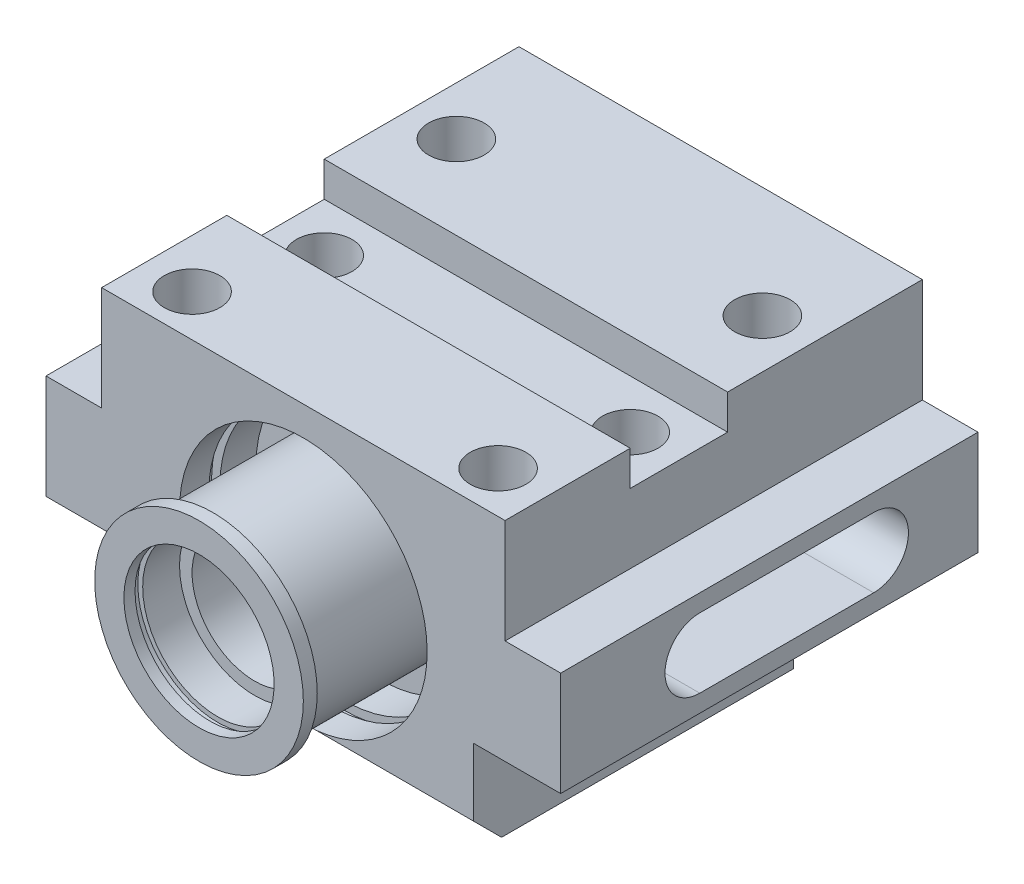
ISO-10303-21;
HEADER;
FILE_DESCRIPTION(('STEP AP214'),'2;1');
FILE_NAME('part.step','',(''),(''),'','','');
FILE_SCHEMA(('AUTOMOTIVE_DESIGN { 1 0 10303 214 1 1 1 1 }'));
ENDSEC;
DATA;
#1=APPLICATION_CONTEXT('core data for automotive mechanical design processes');
#2=APPLICATION_PROTOCOL_DEFINITION('international standard','automotive_design',2000,#1);
#3=PRODUCT_CONTEXT('',#1,'mechanical');
#4=PRODUCT('Part','Part','',(#3));
#5=PRODUCT_RELATED_PRODUCT_CATEGORY('part','',(#4));
#6=PRODUCT_DEFINITION_FORMATION('','',#4);
#7=PRODUCT_DEFINITION_CONTEXT('part definition',#1,'design');
#8=PRODUCT_DEFINITION('design','',#6,#7);
#9=PRODUCT_DEFINITION_SHAPE('','',#8);
#10=(LENGTH_UNIT() NAMED_UNIT(*) SI_UNIT(.MILLI.,.METRE.));
#11=(NAMED_UNIT(*) PLANE_ANGLE_UNIT() SI_UNIT($,.RADIAN.));
#12=(NAMED_UNIT(*) SI_UNIT($,.STERADIAN.) SOLID_ANGLE_UNIT());
#13=UNCERTAINTY_MEASURE_WITH_UNIT(LENGTH_MEASURE(1.E-05),#10,'distance_accuracy_value','');
#14=(GEOMETRIC_REPRESENTATION_CONTEXT(3) GLOBAL_UNCERTAINTY_ASSIGNED_CONTEXT((#13)) GLOBAL_UNIT_ASSIGNED_CONTEXT((#10,
#11,#12)) REPRESENTATION_CONTEXT('',''));
#15=CARTESIAN_POINT('',(0.,0.,0.));
#16=DIRECTION('',(0.,0.,1.));
#17=DIRECTION('',(1.,0.,0.));
#18=AXIS2_PLACEMENT_3D('',#15,#16,#17);
#19=CARTESIAN_POINT('',(0.,-5.,0.));
#20=DIRECTION('',(0.,1.,0.));
#21=DIRECTION('',(0.,0.,1.));
#22=AXIS2_PLACEMENT_3D('',#19,#20,#21);
#23=PLANE('',#22);
#24=CARTESIAN_POINT('',(22.,-5.,5.));
#25=DIRECTION('',(0.,1.,0.));
#26=DIRECTION('',(0.,0.,1.));
#27=AXIS2_PLACEMENT_3D('',#24,#25,#26);
#28=CIRCLE('',#27,4.);
#29=CARTESIAN_POINT('',(22.,-5.,9.));
#30=VERTEX_POINT('',#29);
#31=EDGE_CURVE('E1467',#30,#30,#28,.T.);
#32=ORIENTED_EDGE('',*,*,#31,.F.);
#33=EDGE_LOOP('',(#32));
#34=FACE_BOUND('',#33,.T.);
#35=CARTESIAN_POINT('',(-22.,-5.,5.));
#36=DIRECTION('',(0.,1.,0.));
#37=DIRECTION('',(0.,0.,1.));
#38=AXIS2_PLACEMENT_3D('',#35,#36,#37);
#39=CIRCLE('',#38,4.);
#40=CARTESIAN_POINT('',(-22.,-5.,9.));
#41=VERTEX_POINT('',#40);
#42=EDGE_CURVE('E1473',#41,#41,#39,.T.);
#43=ORIENTED_EDGE('',*,*,#42,.F.);
#44=EDGE_LOOP('',(#43));
#45=FACE_BOUND('',#44,.T.);
#46=DIRECTION('',(0.,0.,1.));
#47=VECTOR('',#46,1.);
#48=CARTESIAN_POINT('',(29.,-5.,30.));
#49=LINE('',#48,#47);
#50=CARTESIAN_POINT('',(29.,-5.,-2.));
#51=VERTEX_POINT('',#50);
#52=CARTESIAN_POINT('',(29.,-5.,12.));
#53=VERTEX_POINT('',#52);
#54=EDGE_CURVE('E572',#51,#53,#49,.T.);
#55=ORIENTED_EDGE('',*,*,#54,.F.);
#56=DIRECTION('',(1.,0.,0.));
#57=VECTOR('',#56,1.);
#58=CARTESIAN_POINT('',(29.,-5.,-2.));
#59=LINE('',#58,#57);
#60=CARTESIAN_POINT('',(-29.,-5.,-2.));
#61=VERTEX_POINT('',#60);
#62=EDGE_CURVE('E515',#61,#51,#59,.T.);
#63=ORIENTED_EDGE('',*,*,#62,.F.);
#64=DIRECTION('',(0.,0.,-1.));
#65=VECTOR('',#64,1.);
#66=CARTESIAN_POINT('',(-29.,-5.,-30.));
#67=LINE('',#66,#65);
#68=CARTESIAN_POINT('',(-29.,-5.,12.));
#69=VERTEX_POINT('',#68);
#70=EDGE_CURVE('E574',#69,#61,#67,.T.);
#71=ORIENTED_EDGE('',*,*,#70,.F.);
#72=DIRECTION('',(-1.,0.,0.));
#73=VECTOR('',#72,1.);
#74=CARTESIAN_POINT('',(29.,-5.,12.));
#75=LINE('',#74,#73);
#76=EDGE_CURVE('E582',#53,#69,#75,.T.);
#77=ORIENTED_EDGE('',*,*,#76,.F.);
#78=EDGE_LOOP('',(#55,#63,#71,#77));
#79=FACE_BOUND('',#78,.T.);
#80=ADVANCED_FACE('F17',(#34,#45,#79),#23,.T.);
#81=CARTESIAN_POINT('',(29.,-5.,30.));
#82=DIRECTION('',(1.,0.,0.));
#83=DIRECTION('',(0.,0.,-1.));
#84=AXIS2_PLACEMENT_3D('',#81,#82,#83);
#85=PLANE('',#84);
#86=DIRECTION('',(0.,0.,1.));
#87=VECTOR('',#86,1.);
#88=CARTESIAN_POINT('',(29.,-15.,30.));
#89=LINE('',#88,#87);
#90=CARTESIAN_POINT('',(29.,-15.,-30.));
#91=VERTEX_POINT('',#90);
#92=CARTESIAN_POINT('',(29.,-15.,30.));
#93=VERTEX_POINT('',#92);
#94=EDGE_CURVE('E555',#91,#93,#89,.T.);
#95=ORIENTED_EDGE('',*,*,#94,.F.);
#96=DIRECTION('',(0.,1.,0.));
#97=VECTOR('',#96,1.);
#98=CARTESIAN_POINT('',(29.,-43.7,-30.));
#99=LINE('',#98,#97);
#100=CARTESIAN_POINT('',(29.,0.,-30.));
#101=VERTEX_POINT('',#100);
#102=EDGE_CURVE('E577',#91,#101,#99,.T.);
#103=ORIENTED_EDGE('',*,*,#102,.T.);
#104=DIRECTION('',(0.,0.,-1.));
#105=VECTOR('',#104,1.);
#106=CARTESIAN_POINT('',(29.,0.,-30.));
#107=LINE('',#106,#105);
#108=CARTESIAN_POINT('',(29.,0.,-2.));
#109=VERTEX_POINT('',#108);
#110=EDGE_CURVE('E524',#109,#101,#107,.T.);
#111=ORIENTED_EDGE('',*,*,#110,.F.);
#112=DIRECTION('',(0.,-1.,0.));
#113=VECTOR('',#112,1.);
#114=CARTESIAN_POINT('',(29.,0.,-2.));
#115=LINE('',#114,#113);
#116=EDGE_CURVE('E536',#109,#51,#115,.T.);
#117=ORIENTED_EDGE('',*,*,#116,.T.);
#118=ORIENTED_EDGE('',*,*,#54,.T.);
#119=DIRECTION('',(0.,1.,0.));
#120=VECTOR('',#119,1.);
#121=CARTESIAN_POINT('',(29.,-5.,12.));
#122=LINE('',#121,#120);
#123=CARTESIAN_POINT('',(29.,0.,12.));
#124=VERTEX_POINT('',#123);
#125=EDGE_CURVE('E585',#53,#124,#122,.T.);
#126=ORIENTED_EDGE('',*,*,#125,.T.);
#127=DIRECTION('',(0.,0.,-1.));
#128=VECTOR('',#127,1.);
#129=CARTESIAN_POINT('',(29.,0.,30.));
#130=LINE('',#129,#128);
#131=CARTESIAN_POINT('',(29.,0.,30.));
#132=VERTEX_POINT('',#131);
#133=EDGE_CURVE('E581',#132,#124,#130,.T.);
#134=ORIENTED_EDGE('',*,*,#133,.F.);
#135=DIRECTION('',(0.,1.,0.));
#136=VECTOR('',#135,1.);
#137=CARTESIAN_POINT('',(29.,-5.,30.));
#138=LINE('',#137,#136);
#139=EDGE_CURVE('E596',#93,#132,#138,.T.);
#140=ORIENTED_EDGE('',*,*,#139,.F.);
#141=EDGE_LOOP('',(#95,#103,#111,#117,#118,#126,#134,#140));
#142=FACE_BOUND('',#141,.T.);
#143=ADVANCED_FACE('F664',(#142),#85,.T.);
#144=CARTESIAN_POINT('',(-29.,-5.,30.));
#145=DIRECTION('',(0.,0.,1.));
#146=DIRECTION('',(1.,0.,0.));
#147=AXIS2_PLACEMENT_3D('',#144,#145,#146);
#148=PLANE('',#147);
#149=DIRECTION('',(0.,1.,0.));
#150=VECTOR('',#149,1.);
#151=CARTESIAN_POINT('',(-24.5,-43.7,30.));
#152=LINE('',#151,#150);
#153=CARTESIAN_POINT('',(-24.5,-39.7,30.));
#154=VERTEX_POINT('',#153);
#155=CARTESIAN_POINT('',(-24.5,-30.,30.));
#156=VERTEX_POINT('',#155);
#157=EDGE_CURVE('E499',#154,#156,#152,.T.);
#158=ORIENTED_EDGE('',*,*,#157,.F.);
#159=DIRECTION('',(1.,0.,0.));
#160=VECTOR('',#159,1.);
#161=CARTESIAN_POINT('',(24.5,-39.7,30.));
#162=LINE('',#161,#160);
#163=CARTESIAN_POINT('',(-1.88414436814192,-39.7,30.));
#164=VERTEX_POINT('',#163);
#165=EDGE_CURVE('E618',#154,#164,#162,.T.);
#166=ORIENTED_EDGE('',*,*,#165,.T.);
#167=CARTESIAN_POINT('',(0.,-22.,30.));
#168=DIRECTION('',(0.,0.,1.));
#169=DIRECTION('',(1.,0.,0.));
#170=AXIS2_PLACEMENT_3D('',#167,#168,#169);
#171=CIRCLE('',#170,17.8);
#172=CARTESIAN_POINT('',(1.88414436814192,-39.7,30.));
#173=VERTEX_POINT('',#172);
#174=EDGE_CURVE('E391',#173,#164,#171,.T.);
#175=ORIENTED_EDGE('',*,*,#174,.F.);
#176=DIRECTION('',(1.,0.,0.));
#177=VECTOR('',#176,1.);
#178=CARTESIAN_POINT('',(24.5,-39.7,30.));
#179=LINE('',#178,#177);
#180=CARTESIAN_POINT('',(24.5,-39.7,30.));
#181=VERTEX_POINT('',#180);
#182=EDGE_CURVE('E33',#173,#181,#179,.T.);
#183=ORIENTED_EDGE('',*,*,#182,.T.);
#184=DIRECTION('',(0.,-1.,0.));
#185=VECTOR('',#184,1.);
#186=CARTESIAN_POINT('',(24.5,-30.,30.));
#187=LINE('',#186,#185);
#188=CARTESIAN_POINT('',(24.5,-30.,30.));
#189=VERTEX_POINT('',#188);
#190=EDGE_CURVE('E489',#189,#181,#187,.T.);
#191=ORIENTED_EDGE('',*,*,#190,.F.);
#192=DIRECTION('',(-1.,0.,0.));
#193=VECTOR('',#192,1.);
#194=CARTESIAN_POINT('',(37.,-30.,30.));
#195=LINE('',#194,#193);
#196=CARTESIAN_POINT('',(37.,-30.,30.));
#197=VERTEX_POINT('',#196);
#198=EDGE_CURVE('E484',#197,#189,#195,.T.);
#199=ORIENTED_EDGE('',*,*,#198,.F.);
#200=DIRECTION('',(0.,-1.,0.));
#201=VECTOR('',#200,1.);
#202=CARTESIAN_POINT('',(37.,-43.7,30.));
#203=LINE('',#202,#201);
#204=CARTESIAN_POINT('',(37.,-15.,30.));
#205=VERTEX_POINT('',#204);
#206=EDGE_CURVE('E559',#205,#197,#203,.T.);
#207=ORIENTED_EDGE('',*,*,#206,.F.);
#208=DIRECTION('',(-1.,0.,0.));
#209=VECTOR('',#208,1.);
#210=CARTESIAN_POINT('',(37.,-15.,30.));
#211=LINE('',#210,#209);
#212=EDGE_CURVE('E569',#205,#93,#211,.T.);
#213=ORIENTED_EDGE('',*,*,#212,.T.);
#214=ORIENTED_EDGE('',*,*,#139,.T.);
#215=DIRECTION('',(1.,0.,0.));
#216=VECTOR('',#215,1.);
#217=CARTESIAN_POINT('',(-29.,0.,30.));
#218=LINE('',#217,#216);
#219=CARTESIAN_POINT('',(-29.,0.,30.));
#220=VERTEX_POINT('',#219);
#221=EDGE_CURVE('E586',#220,#132,#218,.T.);
#222=ORIENTED_EDGE('',*,*,#221,.F.);
#223=DIRECTION('',(0.,1.,0.));
#224=VECTOR('',#223,1.);
#225=CARTESIAN_POINT('',(-29.,-5.,30.));
#226=LINE('',#225,#224);
#227=CARTESIAN_POINT('',(-29.,-15.,30.));
#228=VERTEX_POINT('',#227);
#229=EDGE_CURVE('E600',#228,#220,#226,.T.);
#230=ORIENTED_EDGE('',*,*,#229,.F.);
#231=DIRECTION('',(1.,0.,0.));
#232=VECTOR('',#231,1.);
#233=CARTESIAN_POINT('',(-37.,-15.,30.));
#234=LINE('',#233,#232);
#235=CARTESIAN_POINT('',(-37.,-15.,30.));
#236=VERTEX_POINT('',#235);
#237=EDGE_CURVE('E547',#236,#228,#234,.T.);
#238=ORIENTED_EDGE('',*,*,#237,.F.);
#239=DIRECTION('',(0.,1.,0.));
#240=VECTOR('',#239,1.);
#241=CARTESIAN_POINT('',(-37.,-15.,30.));
#242=LINE('',#241,#240);
#243=CARTESIAN_POINT('',(-37.,-30.,30.));
#244=VERTEX_POINT('',#243);
#245=EDGE_CURVE('E545',#244,#236,#242,.T.);
#246=ORIENTED_EDGE('',*,*,#245,.F.);
#247=DIRECTION('',(-1.,0.,0.));
#248=VECTOR('',#247,1.);
#249=CARTESIAN_POINT('',(-24.5,-30.,30.));
#250=LINE('',#249,#248);
#251=EDGE_CURVE('E506',#156,#244,#250,.T.);
#252=ORIENTED_EDGE('',*,*,#251,.F.);
#253=EDGE_LOOP('',(#158,#166,#175,#183,#191,#199,#207,#213,#214,#222,#230,#238,#246,#252));
#254=FACE_BOUND('',#253,.T.);
#255=ADVANCED_FACE('F621',(#254),#148,.T.);
#256=CARTESIAN_POINT('',(-29.,-5.,12.));
#257=DIRECTION('',(-1.,0.,0.));
#258=DIRECTION('',(0.,0.,1.));
#259=AXIS2_PLACEMENT_3D('',#256,#257,#258);
#260=PLANE('',#259);
#261=DIRECTION('',(0.,0.,-1.));
#262=VECTOR('',#261,1.);
#263=CARTESIAN_POINT('',(-29.,-15.,-30.));
#264=LINE('',#263,#262);
#265=CARTESIAN_POINT('',(-29.,-15.,-30.));
#266=VERTEX_POINT('',#265);
#267=EDGE_CURVE('E538',#228,#266,#264,.T.);
#268=ORIENTED_EDGE('',*,*,#267,.F.);
#269=ORIENTED_EDGE('',*,*,#229,.T.);
#270=DIRECTION('',(0.,0.,1.));
#271=VECTOR('',#270,1.);
#272=CARTESIAN_POINT('',(-29.,0.,12.));
#273=LINE('',#272,#271);
#274=CARTESIAN_POINT('',(-29.,0.,12.));
#275=VERTEX_POINT('',#274);
#276=EDGE_CURVE('E592',#275,#220,#273,.T.);
#277=ORIENTED_EDGE('',*,*,#276,.F.);
#278=DIRECTION('',(0.,1.,0.));
#279=VECTOR('',#278,1.);
#280=CARTESIAN_POINT('',(-29.,-5.,12.));
#281=LINE('',#280,#279);
#282=EDGE_CURVE('E602',#69,#275,#281,.T.);
#283=ORIENTED_EDGE('',*,*,#282,.F.);
#284=ORIENTED_EDGE('',*,*,#70,.T.);
#285=DIRECTION('',(0.,-1.,0.));
#286=VECTOR('',#285,1.);
#287=CARTESIAN_POINT('',(-29.,0.,-2.));
#288=LINE('',#287,#286);
#289=CARTESIAN_POINT('',(-29.,0.,-2.));
#290=VERTEX_POINT('',#289);
#291=EDGE_CURVE('E532',#290,#61,#288,.T.);
#292=ORIENTED_EDGE('',*,*,#291,.F.);
#293=DIRECTION('',(0.,0.,1.));
#294=VECTOR('',#293,1.);
#295=CARTESIAN_POINT('',(-29.,0.,-2.));
#296=LINE('',#295,#294);
#297=CARTESIAN_POINT('',(-29.,0.,-30.));
#298=VERTEX_POINT('',#297);
#299=EDGE_CURVE('E530',#298,#290,#296,.T.);
#300=ORIENTED_EDGE('',*,*,#299,.F.);
#301=DIRECTION('',(0.,1.,0.));
#302=VECTOR('',#301,1.);
#303=CARTESIAN_POINT('',(-29.,-43.7,-30.));
#304=LINE('',#303,#302);
#305=EDGE_CURVE('E579',#266,#298,#304,.T.);
#306=ORIENTED_EDGE('',*,*,#305,.F.);
#307=EDGE_LOOP('',(#268,#269,#277,#283,#284,#292,#300,#306));
#308=FACE_BOUND('',#307,.T.);
#309=ADVANCED_FACE('F672',(#308),#260,.T.);
#310=CARTESIAN_POINT('',(29.,-5.,12.));
#311=DIRECTION('',(0.,0.,-1.));
#312=DIRECTION('',(-1.,0.,0.));
#313=AXIS2_PLACEMENT_3D('',#310,#311,#312);
#314=PLANE('',#313);
#315=DIRECTION('',(-1.,0.,0.));
#316=VECTOR('',#315,1.);
#317=CARTESIAN_POINT('',(29.,0.,12.));
#318=LINE('',#317,#316);
#319=EDGE_CURVE('E589',#124,#275,#318,.T.);
#320=ORIENTED_EDGE('',*,*,#319,.F.);
#321=ORIENTED_EDGE('',*,*,#125,.F.);
#322=ORIENTED_EDGE('',*,*,#76,.T.);
#323=ORIENTED_EDGE('',*,*,#282,.T.);
#324=EDGE_LOOP('',(#320,#321,#322,#323));
#325=FACE_BOUND('',#324,.T.);
#326=ADVANCED_FACE('F699',(#325),#314,.T.);
#327=CARTESIAN_POINT('',(0.,0.,0.));
#328=DIRECTION('',(0.,1.,0.));
#329=DIRECTION('',(0.,0.,1.));
#330=AXIS2_PLACEMENT_3D('',#327,#328,#329);
#331=PLANE('',#330);
#332=CARTESIAN_POINT('',(22.,0.,24.));
#333=DIRECTION('',(0.,1.,0.));
#334=DIRECTION('',(0.,0.,1.));
#335=AXIS2_PLACEMENT_3D('',#332,#333,#334);
#336=CIRCLE('',#335,4.);
#337=CARTESIAN_POINT('',(22.,0.,28.));
#338=VERTEX_POINT('',#337);
#339=EDGE_CURVE('E1483',#338,#338,#336,.T.);
#340=ORIENTED_EDGE('',*,*,#339,.F.);
#341=EDGE_LOOP('',(#340));
#342=FACE_BOUND('',#341,.T.);
#343=CARTESIAN_POINT('',(-22.,0.,24.));
#344=DIRECTION('',(0.,1.,0.));
#345=DIRECTION('',(0.,0.,1.));
#346=AXIS2_PLACEMENT_3D('',#343,#344,#345);
#347=CIRCLE('',#346,4.);
#348=CARTESIAN_POINT('',(-22.,0.,28.));
#349=VERTEX_POINT('',#348);
#350=EDGE_CURVE('E1476',#349,#349,#347,.T.);
#351=ORIENTED_EDGE('',*,*,#350,.F.);
#352=EDGE_LOOP('',(#351));
#353=FACE_BOUND('',#352,.T.);
#354=ORIENTED_EDGE('',*,*,#221,.T.);
#355=ORIENTED_EDGE('',*,*,#133,.T.);
#356=ORIENTED_EDGE('',*,*,#319,.T.);
#357=ORIENTED_EDGE('',*,*,#276,.T.);
#358=EDGE_LOOP('',(#354,#355,#356,#357));
#359=FACE_BOUND('',#358,.T.);
#360=ADVANCED_FACE('F668',(#342,#353,#359),#331,.T.);
#361=CARTESIAN_POINT('',(29.,-43.7,-30.));
#362=DIRECTION('',(0.,0.,1.));
#363=DIRECTION('',(0.,-1.,0.));
#364=AXIS2_PLACEMENT_3D('',#361,#362,#363);
#365=PLANE('',#364);
#366=CARTESIAN_POINT('',(0.,-22.,-30.));
#367=DIRECTION('',(0.,0.,1.));
#368=DIRECTION('',(1.,0.,0.));
#369=AXIS2_PLACEMENT_3D('',#366,#367,#368);
#370=CIRCLE('',#369,17.8);
#371=CARTESIAN_POINT('',(17.8,-22.,-30.));
#372=VERTEX_POINT('',#371);
#373=EDGE_CURVE('E302',#372,#372,#370,.T.);
#374=ORIENTED_EDGE('',*,*,#373,.T.);
#375=EDGE_LOOP('',(#374));
#376=FACE_BOUND('',#375,.T.);
#377=DIRECTION('',(0.,-1.,0.));
#378=VECTOR('',#377,1.);
#379=CARTESIAN_POINT('',(24.5,-30.,-30.));
#380=LINE('',#379,#378);
#381=CARTESIAN_POINT('',(24.5,-30.,-30.));
#382=VERTEX_POINT('',#381);
#383=CARTESIAN_POINT('',(24.5,-42.,-30.));
#384=VERTEX_POINT('',#383);
#385=EDGE_CURVE('E488',#382,#384,#380,.T.);
#386=ORIENTED_EDGE('',*,*,#385,.T.);
#387=DIRECTION('',(1.,0.,0.));
#388=VECTOR('',#387,1.);
#389=CARTESIAN_POINT('',(-37.,-42.,-30.));
#390=LINE('',#389,#388);
#391=CARTESIAN_POINT('',(-24.5,-42.,-30.));
#392=VERTEX_POINT('',#391);
#393=EDGE_CURVE('E471',#392,#384,#390,.T.);
#394=ORIENTED_EDGE('',*,*,#393,.F.);
#395=DIRECTION('',(0.,1.,0.));
#396=VECTOR('',#395,1.);
#397=CARTESIAN_POINT('',(-24.5,-43.7,-30.));
#398=LINE('',#397,#396);
#399=CARTESIAN_POINT('',(-24.5,-30.,-30.));
#400=VERTEX_POINT('',#399);
#401=EDGE_CURVE('E503',#392,#400,#398,.T.);
#402=ORIENTED_EDGE('',*,*,#401,.T.);
#403=DIRECTION('',(-1.,0.,0.));
#404=VECTOR('',#403,1.);
#405=CARTESIAN_POINT('',(-24.5,-30.,-30.));
#406=LINE('',#405,#404);
#407=CARTESIAN_POINT('',(-37.,-30.,-30.));
#408=VERTEX_POINT('',#407);
#409=EDGE_CURVE('E505',#400,#408,#406,.T.);
#410=ORIENTED_EDGE('',*,*,#409,.T.);
#411=DIRECTION('',(0.,-1.,0.));
#412=VECTOR('',#411,1.);
#413=CARTESIAN_POINT('',(-37.,-43.7,-30.));
#414=LINE('',#413,#412);
#415=CARTESIAN_POINT('',(-37.,-15.,-30.));
#416=VERTEX_POINT('',#415);
#417=EDGE_CURVE('E542',#416,#408,#414,.T.);
#418=ORIENTED_EDGE('',*,*,#417,.F.);
#419=DIRECTION('',(1.,0.,0.));
#420=VECTOR('',#419,1.);
#421=CARTESIAN_POINT('',(-37.,-15.,-30.));
#422=LINE('',#421,#420);
#423=EDGE_CURVE('E552',#416,#266,#422,.T.);
#424=ORIENTED_EDGE('',*,*,#423,.T.);
#425=ORIENTED_EDGE('',*,*,#305,.T.);
#426=DIRECTION('',(-1.,0.,0.));
#427=VECTOR('',#426,1.);
#428=CARTESIAN_POINT('',(-29.,0.,-30.));
#429=LINE('',#428,#427);
#430=EDGE_CURVE('E527',#101,#298,#429,.T.);
#431=ORIENTED_EDGE('',*,*,#430,.F.);
#432=ORIENTED_EDGE('',*,*,#102,.F.);
#433=DIRECTION('',(-1.,0.,0.));
#434=VECTOR('',#433,1.);
#435=CARTESIAN_POINT('',(37.,-15.,-30.));
#436=LINE('',#435,#434);
#437=CARTESIAN_POINT('',(37.,-15.,-30.));
#438=VERTEX_POINT('',#437);
#439=EDGE_CURVE('E564',#438,#91,#436,.T.);
#440=ORIENTED_EDGE('',*,*,#439,.F.);
#441=DIRECTION('',(0.,1.,0.));
#442=VECTOR('',#441,1.);
#443=CARTESIAN_POINT('',(37.,-15.,-30.));
#444=LINE('',#443,#442);
#445=CARTESIAN_POINT('',(37.,-30.,-30.));
#446=VERTEX_POINT('',#445);
#447=EDGE_CURVE('E562',#446,#438,#444,.T.);
#448=ORIENTED_EDGE('',*,*,#447,.F.);
#449=DIRECTION('',(-1.,0.,0.));
#450=VECTOR('',#449,1.);
#451=CARTESIAN_POINT('',(37.,-30.,-30.));
#452=LINE('',#451,#450);
#453=EDGE_CURVE('E485',#446,#382,#452,.T.);
#454=ORIENTED_EDGE('',*,*,#453,.T.);
#455=EDGE_LOOP('',(#386,#394,#402,#410,#418,#424,#425,#431,#432,#440,#448,#454));
#456=FACE_BOUND('',#455,.T.);
#457=ADVANCED_FACE('F646',(#376,#456),#365,.F.);
#458=CARTESIAN_POINT('',(0.,-43.7,0.));
#459=DIRECTION('',(0.,1.,0.));
#460=DIRECTION('',(0.,0.,1.));
#461=AXIS2_PLACEMENT_3D('',#458,#459,#460);
#462=PLANE('',#461);
#463=DIRECTION('',(0.,0.,1.));
#464=VECTOR('',#463,1.);
#465=CARTESIAN_POINT('',(24.5,-43.7,-30.));
#466=LINE('',#465,#464);
#467=CARTESIAN_POINT('',(24.5,-43.7,-16.));
#468=VERTEX_POINT('',#467);
#469=CARTESIAN_POINT('',(24.5,-43.7,26.));
#470=VERTEX_POINT('',#469);
#471=EDGE_CURVE('E496',#468,#470,#466,.T.);
#472=ORIENTED_EDGE('',*,*,#471,.T.);
#473=DIRECTION('',(-1.,0.,0.));
#474=VECTOR('',#473,1.);
#475=CARTESIAN_POINT('',(-24.5,-43.7,26.));
#476=LINE('',#475,#474);
#477=CARTESIAN_POINT('',(-24.5,-43.7,26.));
#478=VERTEX_POINT('',#477);
#479=EDGE_CURVE('E612',#470,#478,#476,.T.);
#480=ORIENTED_EDGE('',*,*,#479,.T.);
#481=DIRECTION('',(0.,0.,1.));
#482=VECTOR('',#481,1.);
#483=CARTESIAN_POINT('',(-24.5,-43.7,-30.));
#484=LINE('',#483,#482);
#485=CARTESIAN_POINT('',(-24.5,-43.7,-16.));
#486=VERTEX_POINT('',#485);
#487=EDGE_CURVE('E512',#486,#478,#484,.T.);
#488=ORIENTED_EDGE('',*,*,#487,.F.);
#489=DIRECTION('',(1.,0.,0.));
#490=VECTOR('',#489,1.);
#491=CARTESIAN_POINT('',(-37.,-43.7,-16.));
#492=LINE('',#491,#490);
#493=EDGE_CURVE('E472',#486,#468,#492,.T.);
#494=ORIENTED_EDGE('',*,*,#493,.T.);
#495=EDGE_LOOP('',(#472,#480,#488,#494));
#496=FACE_BOUND('',#495,.T.);
#497=ADVANCED_FACE('F632',(#496),#462,.F.);
#498=CARTESIAN_POINT('',(37.,-15.,30.));
#499=DIRECTION('',(0.,-1.,0.));
#500=DIRECTION('',(0.,0.,-1.));
#501=AXIS2_PLACEMENT_3D('',#498,#499,#500);
#502=PLANE('',#501);
#503=ORIENTED_EDGE('',*,*,#94,.T.);
#504=ORIENTED_EDGE('',*,*,#212,.F.);
#505=DIRECTION('',(0.,0.,1.));
#506=VECTOR('',#505,1.);
#507=CARTESIAN_POINT('',(37.,-15.,30.));
#508=LINE('',#507,#506);
#509=EDGE_CURVE('E556',#438,#205,#508,.T.);
#510=ORIENTED_EDGE('',*,*,#509,.F.);
#511=ORIENTED_EDGE('',*,*,#439,.T.);
#512=EDGE_LOOP('',(#503,#504,#510,#511));
#513=FACE_BOUND('',#512,.T.);
#514=ADVANCED_FACE('F659',(#513),#502,.F.);
#515=CARTESIAN_POINT('',(37.,0.,0.));
#516=DIRECTION('',(-1.,0.,0.));
#517=DIRECTION('',(0.,0.,1.));
#518=AXIS2_PLACEMENT_3D('',#515,#516,#517);
#519=PLANE('',#518);
#520=DIRECTION('',(0.,0.,1.));
#521=VECTOR('',#520,1.);
#522=CARTESIAN_POINT('',(37.,-17.5,-15.));
#523=LINE('',#522,#521);
#524=CARTESIAN_POINT('',(37.,-17.5,-15.));
#525=VERTEX_POINT('',#524);
#526=CARTESIAN_POINT('',(37.,-17.5,10.));
#527=VERTEX_POINT('',#526);
#528=EDGE_CURVE('E450',#525,#527,#523,.T.);
#529=ORIENTED_EDGE('',*,*,#528,.F.);
#530=CARTESIAN_POINT('',(37.,-22.5,-15.));
#531=DIRECTION('',(1.,0.,0.));
#532=DIRECTION('',(0.,0.,-1.));
#533=AXIS2_PLACEMENT_3D('',#530,#531,#532);
#534=CIRCLE('',#533,5.);
#535=CARTESIAN_POINT('',(37.,-27.5,-15.));
#536=VERTEX_POINT('',#535);
#537=EDGE_CURVE('E428',#536,#525,#534,.T.);
#538=ORIENTED_EDGE('',*,*,#537,.F.);
#539=DIRECTION('',(0.,0.,-1.));
#540=VECTOR('',#539,1.);
#541=CARTESIAN_POINT('',(37.,-27.5,10.));
#542=LINE('',#541,#540);
#543=CARTESIAN_POINT('',(37.,-27.5,10.));
#544=VERTEX_POINT('',#543);
#545=EDGE_CURVE('E439',#544,#536,#542,.T.);
#546=ORIENTED_EDGE('',*,*,#545,.F.);
#547=CARTESIAN_POINT('',(37.,-22.5,10.));
#548=DIRECTION('',(1.,0.,0.));
#549=DIRECTION('',(0.,0.,-1.));
#550=AXIS2_PLACEMENT_3D('',#547,#548,#549);
#551=CIRCLE('',#550,5.);
#552=EDGE_CURVE('E453',#527,#544,#551,.T.);
#553=ORIENTED_EDGE('',*,*,#552,.F.);
#554=EDGE_LOOP('',(#529,#538,#546,#553));
#555=FACE_BOUND('',#554,.T.);
#556=ORIENTED_EDGE('',*,*,#206,.T.);
#557=DIRECTION('',(0.,0.,1.));
#558=VECTOR('',#557,1.);
#559=CARTESIAN_POINT('',(37.,-30.,-30.));
#560=LINE('',#559,#558);
#561=EDGE_CURVE('E492',#446,#197,#560,.T.);
#562=ORIENTED_EDGE('',*,*,#561,.F.);
#563=ORIENTED_EDGE('',*,*,#447,.T.);
#564=ORIENTED_EDGE('',*,*,#509,.T.);
#565=EDGE_LOOP('',(#556,#562,#563,#564));
#566=FACE_BOUND('',#565,.T.);
#567=ADVANCED_FACE('F654',(#555,#566),#519,.F.);
#568=CARTESIAN_POINT('',(-37.,-15.,-30.));
#569=DIRECTION('',(0.,-1.,0.));
#570=DIRECTION('',(0.,0.,-1.));
#571=AXIS2_PLACEMENT_3D('',#568,#569,#570);
#572=PLANE('',#571);
#573=ORIENTED_EDGE('',*,*,#267,.T.);
#574=ORIENTED_EDGE('',*,*,#423,.F.);
#575=DIRECTION('',(0.,0.,-1.));
#576=VECTOR('',#575,1.);
#577=CARTESIAN_POINT('',(-37.,-15.,-30.));
#578=LINE('',#577,#576);
#579=EDGE_CURVE('E539',#236,#416,#578,.T.);
#580=ORIENTED_EDGE('',*,*,#579,.F.);
#581=ORIENTED_EDGE('',*,*,#237,.T.);
#582=EDGE_LOOP('',(#573,#574,#580,#581));
#583=FACE_BOUND('',#582,.T.);
#584=ADVANCED_FACE('F677',(#583),#572,.F.);
#585=CARTESIAN_POINT('',(-37.,0.,0.));
#586=DIRECTION('',(1.,0.,0.));
#587=DIRECTION('',(0.,0.,-1.));
#588=AXIS2_PLACEMENT_3D('',#585,#586,#587);
#589=PLANE('',#588);
#590=DIRECTION('',(0.,0.,-1.));
#591=VECTOR('',#590,1.);
#592=CARTESIAN_POINT('',(-37.,-17.5,10.));
#593=LINE('',#592,#591);
#594=CARTESIAN_POINT('',(-37.,-17.5,10.));
#595=VERTEX_POINT('',#594);
#596=CARTESIAN_POINT('',(-37.,-17.5,-15.));
#597=VERTEX_POINT('',#596);
#598=EDGE_CURVE('E418',#595,#597,#593,.T.);
#599=ORIENTED_EDGE('',*,*,#598,.F.);
#600=CARTESIAN_POINT('',(-37.,-22.5,10.));
#601=DIRECTION('',(-1.,0.,0.));
#602=DIRECTION('',(0.,0.,1.));
#603=AXIS2_PLACEMENT_3D('',#600,#601,#602);
#604=CIRCLE('',#603,5.);
#605=CARTESIAN_POINT('',(-37.,-27.5,10.));
#606=VERTEX_POINT('',#605);
#607=EDGE_CURVE('E402',#606,#595,#604,.T.);
#608=ORIENTED_EDGE('',*,*,#607,.F.);
#609=DIRECTION('',(0.,0.,1.));
#610=VECTOR('',#609,1.);
#611=CARTESIAN_POINT('',(-37.,-27.5,-15.));
#612=LINE('',#611,#610);
#613=CARTESIAN_POINT('',(-37.,-27.5,-15.));
#614=VERTEX_POINT('',#613);
#615=EDGE_CURVE('E407',#614,#606,#612,.T.);
#616=ORIENTED_EDGE('',*,*,#615,.F.);
#617=CARTESIAN_POINT('',(-37.,-22.5,-15.));
#618=DIRECTION('',(-1.,0.,0.));
#619=DIRECTION('',(0.,0.,1.));
#620=AXIS2_PLACEMENT_3D('',#617,#618,#619);
#621=CIRCLE('',#620,5.);
#622=EDGE_CURVE('E421',#597,#614,#621,.T.);
#623=ORIENTED_EDGE('',*,*,#622,.F.);
#624=EDGE_LOOP('',(#599,#608,#616,#623));
#625=FACE_BOUND('',#624,.T.);
#626=ORIENTED_EDGE('',*,*,#417,.T.);
#627=DIRECTION('',(0.,0.,1.));
#628=VECTOR('',#627,1.);
#629=CARTESIAN_POINT('',(-37.,-30.,-30.));
#630=LINE('',#629,#628);
#631=EDGE_CURVE('E516',#408,#244,#630,.T.);
#632=ORIENTED_EDGE('',*,*,#631,.T.);
#633=ORIENTED_EDGE('',*,*,#245,.T.);
#634=ORIENTED_EDGE('',*,*,#579,.T.);
#635=EDGE_LOOP('',(#626,#632,#633,#634));
#636=FACE_BOUND('',#635,.T.);
#637=ADVANCED_FACE('F680',(#625,#636),#589,.F.);
#638=CARTESIAN_POINT('',(29.,0.,-2.));
#639=DIRECTION('',(0.,0.,-1.));
#640=DIRECTION('',(0.,1.,0.));
#641=AXIS2_PLACEMENT_3D('',#638,#639,#640);
#642=PLANE('',#641);
#643=ORIENTED_EDGE('',*,*,#62,.T.);
#644=ORIENTED_EDGE('',*,*,#116,.F.);
#645=DIRECTION('',(1.,0.,0.));
#646=VECTOR('',#645,1.);
#647=CARTESIAN_POINT('',(29.,0.,-2.));
#648=LINE('',#647,#646);
#649=EDGE_CURVE('E521',#290,#109,#648,.T.);
#650=ORIENTED_EDGE('',*,*,#649,.F.);
#651=ORIENTED_EDGE('',*,*,#291,.T.);
#652=EDGE_LOOP('',(#643,#644,#650,#651));
#653=FACE_BOUND('',#652,.T.);
#654=ADVANCED_FACE('F694',(#653),#642,.F.);
#655=CARTESIAN_POINT('',(0.,0.,0.));
#656=DIRECTION('',(0.,-1.,0.));
#657=DIRECTION('',(0.,0.,-1.));
#658=AXIS2_PLACEMENT_3D('',#655,#656,#657);
#659=PLANE('',#658);
#660=CARTESIAN_POINT('',(-22.,0.,-14.));
#661=DIRECTION('',(0.,1.,0.));
#662=DIRECTION('',(0.,0.,1.));
#663=AXIS2_PLACEMENT_3D('',#660,#661,#662);
#664=CIRCLE('',#663,4.);
#665=CARTESIAN_POINT('',(-22.,0.,-10.));
#666=VERTEX_POINT('',#665);
#667=EDGE_CURVE('E1487',#666,#666,#664,.T.);
#668=ORIENTED_EDGE('',*,*,#667,.F.);
#669=EDGE_LOOP('',(#668));
#670=FACE_BOUND('',#669,.T.);
#671=CARTESIAN_POINT('',(22.,0.,-14.));
#672=DIRECTION('',(0.,1.,0.));
#673=DIRECTION('',(0.,0.,1.));
#674=AXIS2_PLACEMENT_3D('',#671,#672,#673);
#675=CIRCLE('',#674,4.);
#676=CARTESIAN_POINT('',(22.,0.,-10.));
#677=VERTEX_POINT('',#676);
#678=EDGE_CURVE('E1493',#677,#677,#675,.T.);
#679=ORIENTED_EDGE('',*,*,#678,.F.);
#680=EDGE_LOOP('',(#679));
#681=FACE_BOUND('',#680,.T.);
#682=ORIENTED_EDGE('',*,*,#649,.T.);
#683=ORIENTED_EDGE('',*,*,#110,.T.);
#684=ORIENTED_EDGE('',*,*,#430,.T.);
#685=ORIENTED_EDGE('',*,*,#299,.T.);
#686=EDGE_LOOP('',(#682,#683,#684,#685));
#687=FACE_BOUND('',#686,.T.);
#688=ADVANCED_FACE('F688',(#670,#681,#687),#659,.F.);
#689=CARTESIAN_POINT('',(-24.5,-43.7,-30.));
#690=DIRECTION('',(1.,0.,0.));
#691=DIRECTION('',(0.,0.,-1.));
#692=AXIS2_PLACEMENT_3D('',#689,#690,#691);
#693=PLANE('',#692);
#694=ORIENTED_EDGE('',*,*,#487,.T.);
#695=DIRECTION('',(0.,0.707106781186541,0.707106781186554));
#696=VECTOR('',#695,1.);
#697=CARTESIAN_POINT('',(-24.5,-43.7,26.));
#698=LINE('',#697,#696);
#699=EDGE_CURVE('E615',#478,#154,#698,.T.);
#700=ORIENTED_EDGE('',*,*,#699,.T.);
#701=ORIENTED_EDGE('',*,*,#157,.T.);
#702=DIRECTION('',(0.,0.,1.));
#703=VECTOR('',#702,1.);
#704=CARTESIAN_POINT('',(-24.5,-30.,-30.));
#705=LINE('',#704,#703);
#706=EDGE_CURVE('E509',#400,#156,#705,.T.);
#707=ORIENTED_EDGE('',*,*,#706,.F.);
#708=ORIENTED_EDGE('',*,*,#401,.F.);
#709=DIRECTION('',(0.,0.,1.));
#710=VECTOR('',#709,1.);
#711=CARTESIAN_POINT('',(-24.5,-42.,-30.));
#712=LINE('',#711,#710);
#713=CARTESIAN_POINT('',(-24.5,-42.,-16.));
#714=VERTEX_POINT('',#713);
#715=EDGE_CURVE('E475',#392,#714,#712,.T.);
#716=ORIENTED_EDGE('',*,*,#715,.T.);
#717=DIRECTION('',(0.,-1.,0.));
#718=VECTOR('',#717,1.);
#719=CARTESIAN_POINT('',(-24.5,-43.7,-16.));
#720=LINE('',#719,#718);
#721=EDGE_CURVE('E481',#714,#486,#720,.T.);
#722=ORIENTED_EDGE('',*,*,#721,.T.);
#723=EDGE_LOOP('',(#694,#700,#701,#707,#708,#716,#722));
#724=FACE_BOUND('',#723,.T.);
#725=ADVANCED_FACE('F638',(#724),#693,.F.);
#726=CARTESIAN_POINT('',(-24.5,-30.,-30.));
#727=DIRECTION('',(0.,1.,0.));
#728=DIRECTION('',(0.,0.,1.));
#729=AXIS2_PLACEMENT_3D('',#726,#727,#728);
#730=PLANE('',#729);
#731=ORIENTED_EDGE('',*,*,#251,.T.);
#732=ORIENTED_EDGE('',*,*,#631,.F.);
#733=ORIENTED_EDGE('',*,*,#409,.F.);
#734=ORIENTED_EDGE('',*,*,#706,.T.);
#735=EDGE_LOOP('',(#731,#732,#733,#734));
#736=FACE_BOUND('',#735,.T.);
#737=ADVANCED_FACE('F682',(#736),#730,.F.);
#738=CARTESIAN_POINT('',(24.5,-30.,-30.));
#739=DIRECTION('',(-1.,0.,0.));
#740=DIRECTION('',(0.,0.,1.));
#741=AXIS2_PLACEMENT_3D('',#738,#739,#740);
#742=PLANE('',#741);
#743=ORIENTED_EDGE('',*,*,#190,.T.);
#744=DIRECTION('',(0.,-0.707106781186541,-0.707106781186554));
#745=VECTOR('',#744,1.);
#746=CARTESIAN_POINT('',(24.5,-43.7,26.));
#747=LINE('',#746,#745);
#748=EDGE_CURVE('E11',#181,#470,#747,.T.);
#749=ORIENTED_EDGE('',*,*,#748,.T.);
#750=ORIENTED_EDGE('',*,*,#471,.F.);
#751=DIRECTION('',(0.,-1.,0.));
#752=VECTOR('',#751,1.);
#753=CARTESIAN_POINT('',(24.5,-42.,-16.));
#754=LINE('',#753,#752);
#755=CARTESIAN_POINT('',(24.5,-42.,-16.));
#756=VERTEX_POINT('',#755);
#757=EDGE_CURVE('E469',#756,#468,#754,.T.);
#758=ORIENTED_EDGE('',*,*,#757,.F.);
#759=DIRECTION('',(0.,0.,1.));
#760=VECTOR('',#759,1.);
#761=CARTESIAN_POINT('',(24.5,-42.,-30.));
#762=LINE('',#761,#760);
#763=EDGE_CURVE('E460',#384,#756,#762,.T.);
#764=ORIENTED_EDGE('',*,*,#763,.F.);
#765=ORIENTED_EDGE('',*,*,#385,.F.);
#766=DIRECTION('',(0.,0.,1.));
#767=VECTOR('',#766,1.);
#768=CARTESIAN_POINT('',(24.5,-30.,-30.));
#769=LINE('',#768,#767);
#770=EDGE_CURVE('E500',#382,#189,#769,.T.);
#771=ORIENTED_EDGE('',*,*,#770,.T.);
#772=EDGE_LOOP('',(#743,#749,#750,#758,#764,#765,#771));
#773=FACE_BOUND('',#772,.T.);
#774=ADVANCED_FACE('F629',(#773),#742,.F.);
#775=CARTESIAN_POINT('',(37.,-30.,-30.));
#776=DIRECTION('',(0.,1.,0.));
#777=DIRECTION('',(0.,0.,1.));
#778=AXIS2_PLACEMENT_3D('',#775,#776,#777);
#779=PLANE('',#778);
#780=ORIENTED_EDGE('',*,*,#198,.T.);
#781=ORIENTED_EDGE('',*,*,#770,.F.);
#782=ORIENTED_EDGE('',*,*,#453,.F.);
#783=ORIENTED_EDGE('',*,*,#561,.T.);
#784=EDGE_LOOP('',(#780,#781,#782,#783));
#785=FACE_BOUND('',#784,.T.);
#786=ADVANCED_FACE('F651',(#785),#779,.F.);
#787=CARTESIAN_POINT('',(-37.,-42.,-16.));
#788=DIRECTION('',(0.,0.,1.));
#789=DIRECTION('',(1.,0.,0.));
#790=AXIS2_PLACEMENT_3D('',#787,#788,#789);
#791=PLANE('',#790);
#792=DIRECTION('',(1.,0.,0.));
#793=VECTOR('',#792,1.);
#794=CARTESIAN_POINT('',(-37.,-42.,-16.));
#795=LINE('',#794,#793);
#796=EDGE_CURVE('E476',#714,#756,#795,.T.);
#797=ORIENTED_EDGE('',*,*,#796,.T.);
#798=ORIENTED_EDGE('',*,*,#757,.T.);
#799=ORIENTED_EDGE('',*,*,#493,.F.);
#800=ORIENTED_EDGE('',*,*,#721,.F.);
#801=EDGE_LOOP('',(#797,#798,#799,#800));
#802=FACE_BOUND('',#801,.T.);
#803=ADVANCED_FACE('F635',(#802),#791,.F.);
#804=CARTESIAN_POINT('',(-37.,-42.,-30.));
#805=DIRECTION('',(0.,1.,0.));
#806=DIRECTION('',(0.,0.,1.));
#807=AXIS2_PLACEMENT_3D('',#804,#805,#806);
#808=PLANE('',#807);
#809=ORIENTED_EDGE('',*,*,#393,.T.);
#810=ORIENTED_EDGE('',*,*,#763,.T.);
#811=ORIENTED_EDGE('',*,*,#796,.F.);
#812=ORIENTED_EDGE('',*,*,#715,.F.);
#813=EDGE_LOOP('',(#809,#810,#811,#812));
#814=FACE_BOUND('',#813,.T.);
#815=ADVANCED_FACE('F643',(#814),#808,.F.);
#816=CARTESIAN_POINT('',(27.,-22.5,-15.));
#817=DIRECTION('',(1.,0.,0.));
#818=DIRECTION('',(0.,0.,-1.));
#819=AXIS2_PLACEMENT_3D('',#816,#817,#818);
#820=CYLINDRICAL_SURFACE('',#819,5.);
#821=ORIENTED_EDGE('',*,*,#537,.T.);
#822=DIRECTION('',(1.,0.,0.));
#823=VECTOR('',#822,1.);
#824=CARTESIAN_POINT('',(27.,-17.5,-15.));
#825=LINE('',#824,#823);
#826=CARTESIAN_POINT('',(27.,-17.5,-15.));
#827=VERTEX_POINT('',#826);
#828=EDGE_CURVE('E448',#827,#525,#825,.T.);
#829=ORIENTED_EDGE('',*,*,#828,.F.);
#830=CARTESIAN_POINT('',(27.,-22.5,-15.));
#831=DIRECTION('',(1.,0.,0.));
#832=DIRECTION('',(0.,0.,-1.));
#833=AXIS2_PLACEMENT_3D('',#830,#831,#832);
#834=CIRCLE('',#833,5.);
#835=CARTESIAN_POINT('',(27.,-27.5,-15.));
#836=VERTEX_POINT('',#835);
#837=EDGE_CURVE('E435',#836,#827,#834,.T.);
#838=ORIENTED_EDGE('',*,*,#837,.F.);
#839=DIRECTION('',(1.,0.,0.));
#840=VECTOR('',#839,1.);
#841=CARTESIAN_POINT('',(27.,-27.5,-15.));
#842=LINE('',#841,#840);
#843=EDGE_CURVE('E458',#836,#536,#842,.T.);
#844=ORIENTED_EDGE('',*,*,#843,.T.);
#845=EDGE_LOOP('',(#821,#829,#838,#844));
#846=FACE_BOUND('',#845,.T.);
#847=ADVANCED_FACE('F855',(#846),#820,.F.);
#848=CARTESIAN_POINT('',(27.,-27.5,10.));
#849=DIRECTION('',(0.,-1.,0.));
#850=DIRECTION('',(0.,0.,-1.));
#851=AXIS2_PLACEMENT_3D('',#848,#849,#850);
#852=PLANE('',#851);
#853=ORIENTED_EDGE('',*,*,#545,.T.);
#854=ORIENTED_EDGE('',*,*,#843,.F.);
#855=DIRECTION('',(0.,0.,-1.));
#856=VECTOR('',#855,1.);
#857=CARTESIAN_POINT('',(27.,-27.5,10.));
#858=LINE('',#857,#856);
#859=CARTESIAN_POINT('',(27.,-27.5,10.));
#860=VERTEX_POINT('',#859);
#861=EDGE_CURVE('E445',#860,#836,#858,.T.);
#862=ORIENTED_EDGE('',*,*,#861,.F.);
#863=DIRECTION('',(1.,0.,0.));
#864=VECTOR('',#863,1.);
#865=CARTESIAN_POINT('',(27.,-27.5,10.));
#866=LINE('',#865,#864);
#867=EDGE_CURVE('E461',#860,#544,#866,.T.);
#868=ORIENTED_EDGE('',*,*,#867,.T.);
#869=EDGE_LOOP('',(#853,#854,#862,#868));
#870=FACE_BOUND('',#869,.T.);
#871=ADVANCED_FACE('F863',(#870),#852,.F.);
#872=CARTESIAN_POINT('',(27.,-22.5,10.));
#873=DIRECTION('',(1.,0.,0.));
#874=DIRECTION('',(0.,0.,-1.));
#875=AXIS2_PLACEMENT_3D('',#872,#873,#874);
#876=CYLINDRICAL_SURFACE('',#875,5.);
#877=ORIENTED_EDGE('',*,*,#552,.T.);
#878=ORIENTED_EDGE('',*,*,#867,.F.);
#879=CARTESIAN_POINT('',(27.,-22.5,10.));
#880=DIRECTION('',(1.,0.,0.));
#881=DIRECTION('',(0.,0.,-1.));
#882=AXIS2_PLACEMENT_3D('',#879,#880,#881);
#883=CIRCLE('',#882,5.);
#884=CARTESIAN_POINT('',(27.,-17.5,10.));
#885=VERTEX_POINT('',#884);
#886=EDGE_CURVE('E442',#885,#860,#883,.T.);
#887=ORIENTED_EDGE('',*,*,#886,.F.);
#888=DIRECTION('',(1.,0.,0.));
#889=VECTOR('',#888,1.);
#890=CARTESIAN_POINT('',(27.,-17.5,10.));
#891=LINE('',#890,#889);
#892=EDGE_CURVE('E463',#885,#527,#891,.T.);
#893=ORIENTED_EDGE('',*,*,#892,.T.);
#894=EDGE_LOOP('',(#877,#878,#887,#893));
#895=FACE_BOUND('',#894,.T.);
#896=ADVANCED_FACE('F872',(#895),#876,.F.);
#897=CARTESIAN_POINT('',(27.,-17.5,-15.));
#898=DIRECTION('',(0.,1.,0.));
#899=DIRECTION('',(0.,0.,1.));
#900=AXIS2_PLACEMENT_3D('',#897,#898,#899);
#901=PLANE('',#900);
#902=ORIENTED_EDGE('',*,*,#528,.T.);
#903=ORIENTED_EDGE('',*,*,#892,.F.);
#904=DIRECTION('',(0.,0.,1.));
#905=VECTOR('',#904,1.);
#906=CARTESIAN_POINT('',(27.,-17.5,-15.));
#907=LINE('',#906,#905);
#908=EDGE_CURVE('E438',#827,#885,#907,.T.);
#909=ORIENTED_EDGE('',*,*,#908,.F.);
#910=ORIENTED_EDGE('',*,*,#828,.T.);
#911=EDGE_LOOP('',(#902,#903,#909,#910));
#912=FACE_BOUND('',#911,.T.);
#913=ADVANCED_FACE('F881',(#912),#901,.F.);
#914=CARTESIAN_POINT('',(27.,-22.5,-15.));
#915=DIRECTION('',(1.,0.,0.));
#916=DIRECTION('',(0.,0.,-1.));
#917=AXIS2_PLACEMENT_3D('',#914,#915,#916);
#918=PLANE('',#917);
#919=ORIENTED_EDGE('',*,*,#837,.T.);
#920=ORIENTED_EDGE('',*,*,#908,.T.);
#921=ORIENTED_EDGE('',*,*,#886,.T.);
#922=ORIENTED_EDGE('',*,*,#861,.T.);
#923=EDGE_LOOP('',(#919,#920,#921,#922));
#924=FACE_BOUND('',#923,.T.);
#925=ADVANCED_FACE('F890',(#924),#918,.T.);
#926=CARTESIAN_POINT('',(-27.,-22.5,10.));
#927=DIRECTION('',(-1.,0.,0.));
#928=DIRECTION('',(0.,0.,1.));
#929=AXIS2_PLACEMENT_3D('',#926,#927,#928);
#930=CYLINDRICAL_SURFACE('',#929,5.);
#931=ORIENTED_EDGE('',*,*,#607,.T.);
#932=DIRECTION('',(-1.,0.,0.));
#933=VECTOR('',#932,1.);
#934=CARTESIAN_POINT('',(-27.,-17.5,10.));
#935=LINE('',#934,#933);
#936=CARTESIAN_POINT('',(-27.,-17.5,10.));
#937=VERTEX_POINT('',#936);
#938=EDGE_CURVE('E416',#937,#595,#935,.T.);
#939=ORIENTED_EDGE('',*,*,#938,.F.);
#940=CARTESIAN_POINT('',(-27.,-22.5,10.));
#941=DIRECTION('',(-1.,0.,0.));
#942=DIRECTION('',(0.,0.,1.));
#943=AXIS2_PLACEMENT_3D('',#940,#941,#942);
#944=CIRCLE('',#943,5.);
#945=CARTESIAN_POINT('',(-27.,-27.5,10.));
#946=VERTEX_POINT('',#945);
#947=EDGE_CURVE('E403',#946,#937,#944,.T.);
#948=ORIENTED_EDGE('',*,*,#947,.F.);
#949=DIRECTION('',(-1.,0.,0.));
#950=VECTOR('',#949,1.);
#951=CARTESIAN_POINT('',(-27.,-27.5,10.));
#952=LINE('',#951,#950);
#953=EDGE_CURVE('E426',#946,#606,#952,.T.);
#954=ORIENTED_EDGE('',*,*,#953,.T.);
#955=EDGE_LOOP('',(#931,#939,#948,#954));
#956=FACE_BOUND('',#955,.T.);
#957=ADVANCED_FACE('F899',(#956),#930,.F.);
#958=CARTESIAN_POINT('',(-27.,-27.5,-15.));
#959=DIRECTION('',(0.,-1.,0.));
#960=DIRECTION('',(0.,0.,-1.));
#961=AXIS2_PLACEMENT_3D('',#958,#959,#960);
#962=PLANE('',#961);
#963=ORIENTED_EDGE('',*,*,#615,.T.);
#964=ORIENTED_EDGE('',*,*,#953,.F.);
#965=DIRECTION('',(0.,0.,1.));
#966=VECTOR('',#965,1.);
#967=CARTESIAN_POINT('',(-27.,-27.5,-15.));
#968=LINE('',#967,#966);
#969=CARTESIAN_POINT('',(-27.,-27.5,-15.));
#970=VERTEX_POINT('',#969);
#971=EDGE_CURVE('E413',#970,#946,#968,.T.);
#972=ORIENTED_EDGE('',*,*,#971,.F.);
#973=DIRECTION('',(-1.,0.,0.));
#974=VECTOR('',#973,1.);
#975=CARTESIAN_POINT('',(-27.,-27.5,-15.));
#976=LINE('',#975,#974);
#977=EDGE_CURVE('E429',#970,#614,#976,.T.);
#978=ORIENTED_EDGE('',*,*,#977,.T.);
#979=EDGE_LOOP('',(#963,#964,#972,#978));
#980=FACE_BOUND('',#979,.T.);
#981=ADVANCED_FACE('F908',(#980),#962,.F.);
#982=CARTESIAN_POINT('',(-27.,-22.5,-15.));
#983=DIRECTION('',(-1.,0.,0.));
#984=DIRECTION('',(0.,0.,1.));
#985=AXIS2_PLACEMENT_3D('',#982,#983,#984);
#986=CYLINDRICAL_SURFACE('',#985,5.);
#987=ORIENTED_EDGE('',*,*,#622,.T.);
#988=ORIENTED_EDGE('',*,*,#977,.F.);
#989=CARTESIAN_POINT('',(-27.,-22.5,-15.));
#990=DIRECTION('',(-1.,0.,0.));
#991=DIRECTION('',(0.,0.,1.));
#992=AXIS2_PLACEMENT_3D('',#989,#990,#991);
#993=CIRCLE('',#992,5.);
#994=CARTESIAN_POINT('',(-27.,-17.5,-15.));
#995=VERTEX_POINT('',#994);
#996=EDGE_CURVE('E410',#995,#970,#993,.T.);
#997=ORIENTED_EDGE('',*,*,#996,.F.);
#998=DIRECTION('',(-1.,0.,0.));
#999=VECTOR('',#998,1.);
#1000=CARTESIAN_POINT('',(-27.,-17.5,-15.));
#1001=LINE('',#1000,#999);
#1002=EDGE_CURVE('E431',#995,#597,#1001,.T.);
#1003=ORIENTED_EDGE('',*,*,#1002,.T.);
#1004=EDGE_LOOP('',(#987,#988,#997,#1003));
#1005=FACE_BOUND('',#1004,.T.);
#1006=ADVANCED_FACE('F917',(#1005),#986,.F.);
#1007=CARTESIAN_POINT('',(-27.,-17.5,10.));
#1008=DIRECTION('',(0.,1.,0.));
#1009=DIRECTION('',(0.,0.,1.));
#1010=AXIS2_PLACEMENT_3D('',#1007,#1008,#1009);
#1011=PLANE('',#1010);
#1012=ORIENTED_EDGE('',*,*,#598,.T.);
#1013=ORIENTED_EDGE('',*,*,#1002,.F.);
#1014=DIRECTION('',(0.,0.,-1.));
#1015=VECTOR('',#1014,1.);
#1016=CARTESIAN_POINT('',(-27.,-17.5,10.));
#1017=LINE('',#1016,#1015);
#1018=EDGE_CURVE('E406',#937,#995,#1017,.T.);
#1019=ORIENTED_EDGE('',*,*,#1018,.F.);
#1020=ORIENTED_EDGE('',*,*,#938,.T.);
#1021=EDGE_LOOP('',(#1012,#1013,#1019,#1020));
#1022=FACE_BOUND('',#1021,.T.);
#1023=ADVANCED_FACE('F926',(#1022),#1011,.F.);
#1024=CARTESIAN_POINT('',(-27.,-22.5,10.));
#1025=DIRECTION('',(-1.,0.,0.));
#1026=DIRECTION('',(0.,0.,1.));
#1027=AXIS2_PLACEMENT_3D('',#1024,#1025,#1026);
#1028=PLANE('',#1027);
#1029=ORIENTED_EDGE('',*,*,#947,.T.);
#1030=ORIENTED_EDGE('',*,*,#1018,.T.);
#1031=ORIENTED_EDGE('',*,*,#996,.T.);
#1032=ORIENTED_EDGE('',*,*,#971,.T.);
#1033=EDGE_LOOP('',(#1029,#1030,#1031,#1032));
#1034=FACE_BOUND('',#1033,.T.);
#1035=ADVANCED_FACE('F935',(#1034),#1028,.T.);
#1036=CARTESIAN_POINT('',(0.,-22.,-3.00000000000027));
#1037=DIRECTION('',(0.,0.,1.));
#1038=DIRECTION('',(0.,-1.,0.));
#1039=AXIS2_PLACEMENT_3D('',#1036,#1037,#1038);
#1040=PLANE('',#1039);
#1041=CARTESIAN_POINT('',(0.,-22.0000000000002,-3.00000000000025));
#1042=DIRECTION('',(0.,0.,-1.));
#1043=DIRECTION('',(-1.,0.,0.));
#1044=AXIS2_PLACEMENT_3D('',#1041,#1042,#1043);
#1045=CIRCLE('',#1044,13.5);
#1046=CARTESIAN_POINT('',(-13.5,-22.0000000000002,-3.00000000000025));
#1047=VERTEX_POINT('',#1046);
#1048=EDGE_CURVE('E362',#1047,#1047,#1045,.T.);
#1049=ORIENTED_EDGE('',*,*,#1048,.F.);
#1050=EDGE_LOOP('',(#1049));
#1051=FACE_BOUND('',#1050,.T.);
#1052=CARTESIAN_POINT('',(0.,-22.,-3.00000000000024));
#1053=DIRECTION('',(0.,0.,-1.));
#1054=DIRECTION('',(0.,1.,0.));
#1055=AXIS2_PLACEMENT_3D('',#1052,#1053,#1054);
#1056=CIRCLE('',#1055,14.);
#1057=CARTESIAN_POINT('',(0.,-8.,-3.00000000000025));
#1058=VERTEX_POINT('',#1057);
#1059=EDGE_CURVE('E399',#1058,#1058,#1056,.T.);
#1060=ORIENTED_EDGE('',*,*,#1059,.T.);
#1061=EDGE_LOOP('',(#1060));
#1062=FACE_BOUND('',#1061,.T.);
#1063=ADVANCED_FACE('F944',(#1051,#1062),#1040,.F.);
#1064=CARTESIAN_POINT('',(0.,-22.,-30.));
#1065=DIRECTION('',(0.,0.,-1.));
#1066=DIRECTION('',(0.,1.,0.));
#1067=AXIS2_PLACEMENT_3D('',#1064,#1065,#1066);
#1068=CYLINDRICAL_SURFACE('',#1067,14.);
#1069=CARTESIAN_POINT('',(0.,-22.,-22.));
#1070=DIRECTION('',(0.,0.,1.));
#1071=DIRECTION('',(1.,0.,0.));
#1072=AXIS2_PLACEMENT_3D('',#1069,#1070,#1071);
#1073=CIRCLE('',#1072,14.);
#1074=CARTESIAN_POINT('',(14.,-22.,-22.));
#1075=VERTEX_POINT('',#1074);
#1076=EDGE_CURVE('E299',#1075,#1075,#1073,.T.);
#1077=ORIENTED_EDGE('',*,*,#1076,.F.);
#1078=EDGE_LOOP('',(#1077));
#1079=FACE_BOUND('',#1078,.T.);
#1080=ORIENTED_EDGE('',*,*,#1059,.F.);
#1081=EDGE_LOOP('',(#1080));
#1082=FACE_BOUND('',#1081,.T.);
#1083=ADVANCED_FACE('F953',(#1079,#1082),#1068,.F.);
#1084=CARTESIAN_POINT('',(17.8,-22.,19.));
#1085=DIRECTION('',(0.,0.,-1.));
#1086=DIRECTION('',(-1.,0.,0.));
#1087=AXIS2_PLACEMENT_3D('',#1084,#1085,#1086);
#1088=PLANE('',#1087);
#1089=CARTESIAN_POINT('',(0.,-22.,19.));
#1090=DIRECTION('',(0.,0.,1.));
#1091=DIRECTION('',(1.,0.,0.));
#1092=AXIS2_PLACEMENT_3D('',#1089,#1090,#1091);
#1093=CIRCLE('',#1092,14.);
#1094=CARTESIAN_POINT('',(14.,-22.,19.));
#1095=VERTEX_POINT('',#1094);
#1096=EDGE_CURVE('E393',#1095,#1095,#1093,.T.);
#1097=ORIENTED_EDGE('',*,*,#1096,.F.);
#1098=EDGE_LOOP('',(#1097));
#1099=FACE_BOUND('',#1098,.T.);
#1100=CARTESIAN_POINT('',(0.,-22.,19.));
#1101=DIRECTION('',(0.,0.,1.));
#1102=DIRECTION('',(1.,0.,0.));
#1103=AXIS2_PLACEMENT_3D('',#1100,#1101,#1102);
#1104=CIRCLE('',#1103,17.8);
#1105=CARTESIAN_POINT('',(17.8,-22.,19.));
#1106=VERTEX_POINT('',#1105);
#1107=EDGE_CURVE('E377',#1106,#1106,#1104,.T.);
#1108=ORIENTED_EDGE('',*,*,#1107,.T.);
#1109=EDGE_LOOP('',(#1108));
#1110=FACE_BOUND('',#1109,.T.);
#1111=ADVANCED_FACE('F962',(#1099,#1110),#1088,.F.);
#1112=CARTESIAN_POINT('',(0.,-22.,19.));
#1113=DIRECTION('',(0.,0.,1.));
#1114=DIRECTION('',(1.,0.,0.));
#1115=AXIS2_PLACEMENT_3D('',#1112,#1113,#1114);
#1116=CYLINDRICAL_SURFACE('',#1115,17.8);
#1117=CARTESIAN_POINT('',(0.,-22.,25.8));
#1118=DIRECTION('',(0.,0.,1.));
#1119=DIRECTION('',(1.,0.,0.));
#1120=AXIS2_PLACEMENT_3D('',#1117,#1118,#1119);
#1121=CIRCLE('',#1120,17.8);
#1122=CARTESIAN_POINT('',(17.8,-22.,25.8));
#1123=VERTEX_POINT('',#1122);
#1124=EDGE_CURVE('E388',#1123,#1123,#1121,.T.);
#1125=ORIENTED_EDGE('',*,*,#1124,.F.);
#1126=EDGE_LOOP('',(#1125));
#1127=FACE_BOUND('',#1126,.T.);
#1128=ORIENTED_EDGE('',*,*,#174,.T.);
#1129=CARTESIAN_POINT('',(0.,-22.,47.7));
#1130=DIRECTION('',(0.,-0.707106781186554,0.707106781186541));
#1131=DIRECTION('',(0.,0.707106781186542,0.707106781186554));
#1132=AXIS2_PLACEMENT_3D('',#1129,#1130,#1131);
#1133=ELLIPSE('',#1132,25.1730014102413,17.8);
#1134=EDGE_CURVE('E26',#164,#173,#1133,.T.);
#1135=ORIENTED_EDGE('',*,*,#1134,.T.);
#1136=EDGE_LOOP('',(#1128,#1135));
#1137=FACE_BOUND('',#1136,.T.);
#1138=ADVANCED_FACE('F624',(#1127,#1137),#1116,.F.);
#1139=CARTESIAN_POINT('',(17.8,-22.,25.8));
#1140=DIRECTION('',(0.,0.,1.));
#1141=DIRECTION('',(1.,0.,0.));
#1142=AXIS2_PLACEMENT_3D('',#1139,#1140,#1141);
#1143=PLANE('',#1142);
#1144=CARTESIAN_POINT('',(0.,-22.,25.8));
#1145=DIRECTION('',(0.,0.,1.));
#1146=DIRECTION('',(1.,0.,0.));
#1147=AXIS2_PLACEMENT_3D('',#1144,#1145,#1146);
#1148=CIRCLE('',#1147,19.);
#1149=CARTESIAN_POINT('',(19.,-22.,25.8));
#1150=VERTEX_POINT('',#1149);
#1151=EDGE_CURVE('E385',#1150,#1150,#1148,.T.);
#1152=ORIENTED_EDGE('',*,*,#1151,.F.);
#1153=EDGE_LOOP('',(#1152));
#1154=FACE_BOUND('',#1153,.T.);
#1155=ORIENTED_EDGE('',*,*,#1124,.T.);
#1156=EDGE_LOOP('',(#1155));
#1157=FACE_BOUND('',#1156,.T.);
#1158=ADVANCED_FACE('F979',(#1154,#1157),#1143,.F.);
#1159=CARTESIAN_POINT('',(0.,-22.,19.));
#1160=DIRECTION('',(0.,0.,1.));
#1161=DIRECTION('',(1.,0.,0.));
#1162=AXIS2_PLACEMENT_3D('',#1159,#1160,#1161);
#1163=CYLINDRICAL_SURFACE('',#1162,19.);
#1164=DIRECTION('',(0.,0.,1.));
#1165=VECTOR('',#1164,1.);
#1166=CARTESIAN_POINT('',(-18.0277563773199,-16.,19.));
#1167=LINE('',#1166,#1165);
#1168=CARTESIAN_POINT('',(-18.0277563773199,-16.,24.2));
#1169=VERTEX_POINT('',#1168);
#1170=CARTESIAN_POINT('',(-18.0277563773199,-16.,24.4704047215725));
#1171=VERTEX_POINT('',#1170);
#1172=EDGE_CURVE('E239',#1169,#1171,#1167,.T.);
#1173=ORIENTED_EDGE('',*,*,#1172,.T.);
#1174=CARTESIAN_POINT('',(-18.0277563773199,-16.,24.4704047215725));
#1175=CARTESIAN_POINT('',(-18.0251635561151,-15.992209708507,24.4485136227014));
#1176=CARTESIAN_POINT('',(-18.0227315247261,-15.9849190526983,24.4264236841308));
#1177=CARTESIAN_POINT('',(-18.0182148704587,-15.9714028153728,24.3819485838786));
#1178=CARTESIAN_POINT('',(-18.0161293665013,-15.9651745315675,24.3595643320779));
#1179=CARTESIAN_POINT('',(-18.0123179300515,-15.9538079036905,24.3144887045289));
#1180=CARTESIAN_POINT('',(-18.0105920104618,-15.9486695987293,24.2917973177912));
#1181=CARTESIAN_POINT('',(-18.0075120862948,-15.9395106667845,24.2461039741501));
#1182=CARTESIAN_POINT('',(-18.0061590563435,-15.9354929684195,24.2231013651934));
#1183=CARTESIAN_POINT('',(-18.0050031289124,-15.9320627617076,24.2));
#1184=B_SPLINE_CURVE_WITH_KNOTS('',3,(#1174,#1175,#1176,#1177,#1178,#1179,#1180,#1181,#1182,
#1183),.UNSPECIFIED.,.F.,.F.,(4,2,2,2,4),(0.,0.0701364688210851,0.140091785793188,
0.210049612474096,0.280188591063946),.UNSPECIFIED.);
#1185=CARTESIAN_POINT('',(-18.0050031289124,-15.9320627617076,24.2));
#1186=VERTEX_POINT('',#1185);
#1187=EDGE_CURVE('E227',#1171,#1186,#1184,.T.);
#1188=ORIENTED_EDGE('',*,*,#1187,.T.);
#1189=CARTESIAN_POINT('',(0.,-22.,24.2));
#1190=DIRECTION('',(0.,0.,1.));
#1191=DIRECTION('',(1.,0.,0.));
#1192=AXIS2_PLACEMENT_3D('',#1189,#1190,#1191);
#1193=CIRCLE('',#1192,19.);
#1194=CARTESIAN_POINT('',(18.0050031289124,-15.9320627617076,24.2));
#1195=VERTEX_POINT('',#1194);
#1196=EDGE_CURVE('E383',#1195,#1186,#1193,.T.);
#1197=ORIENTED_EDGE('',*,*,#1196,.F.);
#1198=CARTESIAN_POINT('',(18.0050031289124,-15.9320627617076,24.2));
#1199=CARTESIAN_POINT('',(18.0061590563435,-15.9354929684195,24.2231013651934));
#1200=CARTESIAN_POINT('',(18.0075120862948,-15.9395106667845,24.2461039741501));
#1201=CARTESIAN_POINT('',(18.0105920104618,-15.9486695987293,24.2917973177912));
#1202=CARTESIAN_POINT('',(18.0123179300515,-15.9538079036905,24.3144887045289));
#1203=CARTESIAN_POINT('',(18.0161293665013,-15.9651745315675,24.3595643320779));
#1204=CARTESIAN_POINT('',(18.0182148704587,-15.9714028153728,24.3819485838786));
#1205=CARTESIAN_POINT('',(18.0227315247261,-15.9849190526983,24.4264236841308));
#1206=CARTESIAN_POINT('',(18.0251635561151,-15.992209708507,24.4485136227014));
#1207=CARTESIAN_POINT('',(18.0277563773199,-16.,24.4704047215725));
#1208=B_SPLINE_CURVE_WITH_KNOTS('',3,(#1198,#1199,#1200,#1201,#1202,#1203,#1204,#1205,#1206,
#1207),.UNSPECIFIED.,.F.,.F.,(4,2,2,2,4),(0.,0.0701389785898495,0.140096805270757,
0.21005212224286,0.280188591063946),.UNSPECIFIED.);
#1209=CARTESIAN_POINT('',(18.0277563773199,-16.,24.4704047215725));
#1210=VERTEX_POINT('',#1209);
#1211=EDGE_CURVE('E282',#1195,#1210,#1208,.T.);
#1212=ORIENTED_EDGE('',*,*,#1211,.T.);
#1213=DIRECTION('',(0.,0.,1.));
#1214=VECTOR('',#1213,1.);
#1215=CARTESIAN_POINT('',(18.0277563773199,-16.,19.));
#1216=LINE('',#1215,#1214);
#1217=CARTESIAN_POINT('',(18.0277563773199,-16.,24.2));
#1218=VERTEX_POINT('',#1217);
#1219=EDGE_CURVE('E290',#1210,#1218,#1216,.F.);
#1220=ORIENTED_EDGE('',*,*,#1219,.T.);
#1221=EDGE_CURVE('E251',#1169,#1218,#1193,.T.);
#1222=ORIENTED_EDGE('',*,*,#1221,.F.);
#1223=EDGE_LOOP('',(#1173,#1188,#1197,#1212,#1220,#1222));
#1224=FACE_BOUND('',#1223,.T.);
#1225=ORIENTED_EDGE('',*,*,#1151,.T.);
#1226=EDGE_LOOP('',(#1225));
#1227=FACE_BOUND('',#1226,.T.);
#1228=ADVANCED_FACE('F248',(#1224,#1227),#1163,.F.);
#1229=CARTESIAN_POINT('',(19.,-22.,24.2));
#1230=DIRECTION('',(0.,0.,-1.));
#1231=DIRECTION('',(-1.,0.,0.));
#1232=AXIS2_PLACEMENT_3D('',#1229,#1230,#1231);
#1233=PLANE('',#1232);
#1234=CARTESIAN_POINT('',(0.,-22.,24.2));
#1235=DIRECTION('',(0.,0.,1.));
#1236=DIRECTION('',(1.,0.,0.));
#1237=AXIS2_PLACEMENT_3D('',#1234,#1235,#1236);
#1238=CIRCLE('',#1237,17.8);
#1239=CARTESIAN_POINT('',(17.8,-22.,24.2));
#1240=VERTEX_POINT('',#1239);
#1241=EDGE_CURVE('E380',#1240,#1240,#1238,.T.);
#1242=ORIENTED_EDGE('',*,*,#1241,.F.);
#1243=EDGE_LOOP('',(#1242));
#1244=FACE_BOUND('',#1243,.T.);
#1245=ORIENTED_EDGE('',*,*,#1196,.T.);
#1246=DIRECTION('',(0.,1.,0.));
#1247=VECTOR('',#1246,1.);
#1248=CARTESIAN_POINT('',(-18.0050031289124,-16.,24.2));
#1249=LINE('',#1248,#1247);
#1250=CARTESIAN_POINT('',(-18.0050031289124,-16.,24.2));
#1251=VERTEX_POINT('',#1250);
#1252=EDGE_CURVE('E233',#1186,#1251,#1249,.F.);
#1253=ORIENTED_EDGE('',*,*,#1252,.T.);
#1254=DIRECTION('',(-1.,0.,0.));
#1255=VECTOR('',#1254,1.);
#1256=CARTESIAN_POINT('',(19.,-16.,24.2));
#1257=LINE('',#1256,#1255);
#1258=EDGE_CURVE('E244',#1251,#1169,#1257,.T.);
#1259=ORIENTED_EDGE('',*,*,#1258,.T.);
#1260=ORIENTED_EDGE('',*,*,#1221,.T.);
#1261=DIRECTION('',(-1.,0.,0.));
#1262=VECTOR('',#1261,1.);
#1263=CARTESIAN_POINT('',(19.,-16.,24.2));
#1264=LINE('',#1263,#1262);
#1265=CARTESIAN_POINT('',(18.0050031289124,-16.,24.2));
#1266=VERTEX_POINT('',#1265);
#1267=EDGE_CURVE('E599',#1218,#1266,#1264,.T.);
#1268=ORIENTED_EDGE('',*,*,#1267,.T.);
#1269=DIRECTION('',(0.,1.,0.));
#1270=VECTOR('',#1269,1.);
#1271=CARTESIAN_POINT('',(18.0050031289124,-16.,24.2));
#1272=LINE('',#1271,#1270);
#1273=EDGE_CURVE('E607',#1266,#1195,#1272,.T.);
#1274=ORIENTED_EDGE('',*,*,#1273,.T.);
#1275=EDGE_LOOP('',(#1245,#1253,#1259,#1260,#1268,#1274));
#1276=FACE_BOUND('',#1275,.T.);
#1277=ADVANCED_FACE('F995',(#1244,#1276),#1233,.F.);
#1278=CARTESIAN_POINT('',(0.,-22.,19.));
#1279=DIRECTION('',(0.,0.,1.));
#1280=DIRECTION('',(1.,0.,0.));
#1281=AXIS2_PLACEMENT_3D('',#1278,#1279,#1280);
#1282=CYLINDRICAL_SURFACE('',#1281,17.8);
#1283=ORIENTED_EDGE('',*,*,#1107,.F.);
#1284=EDGE_LOOP('',(#1283));
#1285=FACE_BOUND('',#1284,.T.);
#1286=ORIENTED_EDGE('',*,*,#1241,.T.);
#1287=EDGE_LOOP('',(#1286));
#1288=FACE_BOUND('',#1287,.T.);
#1289=ADVANCED_FACE('F1002',(#1285,#1288),#1282,.F.);
#1290=CARTESIAN_POINT('',(0.,-22.,17.));
#1291=DIRECTION('',(0.,0.,-1.));
#1292=DIRECTION('',(-1.,0.,0.));
#1293=AXIS2_PLACEMENT_3D('',#1290,#1291,#1292);
#1294=PLANE('',#1293);
#1295=CARTESIAN_POINT('',(0.,-22.,16.9999999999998));
#1296=DIRECTION('',(0.,0.,1.));
#1297=DIRECTION('',(1.,0.,0.));
#1298=AXIS2_PLACEMENT_3D('',#1295,#1296,#1297);
#1299=CIRCLE('',#1298,13.5);
#1300=CARTESIAN_POINT('',(13.5,-22.,16.9999999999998));
#1301=VERTEX_POINT('',#1300);
#1302=EDGE_CURVE('E374',#1301,#1301,#1299,.T.);
#1303=ORIENTED_EDGE('',*,*,#1302,.F.);
#1304=EDGE_LOOP('',(#1303));
#1305=FACE_BOUND('',#1304,.T.);
#1306=CARTESIAN_POINT('',(0.,-22.,16.9999999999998));
#1307=DIRECTION('',(0.,0.,1.));
#1308=DIRECTION('',(1.,0.,0.));
#1309=AXIS2_PLACEMENT_3D('',#1306,#1307,#1308);
#1310=CIRCLE('',#1309,14.);
#1311=CARTESIAN_POINT('',(14.,-22.,16.9999999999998));
#1312=VERTEX_POINT('',#1311);
#1313=EDGE_CURVE('E396',#1312,#1312,#1310,.T.);
#1314=ORIENTED_EDGE('',*,*,#1313,.T.);
#1315=EDGE_LOOP('',(#1314));
#1316=FACE_BOUND('',#1315,.T.);
#1317=ADVANCED_FACE('F1010',(#1305,#1316),#1294,.F.);
#1318=CARTESIAN_POINT('',(0.,-22.,30.));
#1319=DIRECTION('',(0.,0.,1.));
#1320=DIRECTION('',(1.,0.,0.));
#1321=AXIS2_PLACEMENT_3D('',#1318,#1319,#1320);
#1322=CYLINDRICAL_SURFACE('',#1321,14.);
#1323=ORIENTED_EDGE('',*,*,#1096,.T.);
#1324=EDGE_LOOP('',(#1323));
#1325=FACE_BOUND('',#1324,.T.);
#1326=ORIENTED_EDGE('',*,*,#1313,.F.);
#1327=EDGE_LOOP('',(#1326));
#1328=FACE_BOUND('',#1327,.T.);
#1329=ADVANCED_FACE('F1019',(#1325,#1328),#1322,.F.);
#1330=CARTESIAN_POINT('',(0.,-22.,16.9999999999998));
#1331=DIRECTION('',(0.,0.,1.));
#1332=DIRECTION('',(1.,0.,0.));
#1333=AXIS2_PLACEMENT_3D('',#1330,#1331,#1332);
#1334=CYLINDRICAL_SURFACE('',#1333,13.5);
#1335=ORIENTED_EDGE('',*,*,#1302,.T.);
#1336=EDGE_LOOP('',(#1335));
#1337=FACE_BOUND('',#1336,.T.);
#1338=CARTESIAN_POINT('',(0.,-22.,43.));
#1339=DIRECTION('',(0.,0.,1.));
#1340=DIRECTION('',(1.,0.,0.));
#1341=AXIS2_PLACEMENT_3D('',#1338,#1339,#1340);
#1342=CIRCLE('',#1341,13.5);
#1343=CARTESIAN_POINT('',(13.5,-22.,43.));
#1344=VERTEX_POINT('',#1343);
#1345=EDGE_CURVE('E365',#1344,#1344,#1342,.T.);
#1346=ORIENTED_EDGE('',*,*,#1345,.F.);
#1347=EDGE_LOOP('',(#1346));
#1348=FACE_BOUND('',#1347,.T.);
#1349=ADVANCED_FACE('F1028',(#1337,#1348),#1334,.T.);
#1350=CARTESIAN_POINT('',(0.,-22.,45.));
#1351=DIRECTION('',(0.,0.,1.));
#1352=DIRECTION('',(1.,0.,0.));
#1353=AXIS2_PLACEMENT_3D('',#1350,#1351,#1352);
#1354=PLANE('',#1353);
#1355=CARTESIAN_POINT('',(0.,-22.0000000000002,45.));
#1356=DIRECTION('',(0.,0.,-1.));
#1357=DIRECTION('',(-1.,0.,0.));
#1358=AXIS2_PLACEMENT_3D('',#1355,#1356,#1357);
#1359=CIRCLE('',#1358,10.8);
#1360=CARTESIAN_POINT('',(-10.8,-22.0000000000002,45.));
#1361=VERTEX_POINT('',#1360);
#1362=EDGE_CURVE('E344',#1361,#1361,#1359,.T.);
#1363=ORIENTED_EDGE('',*,*,#1362,.T.);
#1364=EDGE_LOOP('',(#1363));
#1365=FACE_BOUND('',#1364,.T.);
#1366=CARTESIAN_POINT('',(0.,-22.,45.));
#1367=DIRECTION('',(0.,0.,1.));
#1368=DIRECTION('',(1.,0.,0.));
#1369=AXIS2_PLACEMENT_3D('',#1366,#1367,#1368);
#1370=CIRCLE('',#1369,15.);
#1371=CARTESIAN_POINT('',(15.,-22.,45.));
#1372=VERTEX_POINT('',#1371);
#1373=EDGE_CURVE('E371',#1372,#1372,#1370,.T.);
#1374=ORIENTED_EDGE('',*,*,#1373,.T.);
#1375=EDGE_LOOP('',(#1374));
#1376=FACE_BOUND('',#1375,.T.);
#1377=ADVANCED_FACE('F1037',(#1365,#1376),#1354,.T.);
#1378=CARTESIAN_POINT('',(0.,-22.,16.9999999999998));
#1379=DIRECTION('',(0.,0.,1.));
#1380=DIRECTION('',(1.,0.,0.));
#1381=AXIS2_PLACEMENT_3D('',#1378,#1379,#1380);
#1382=CYLINDRICAL_SURFACE('',#1381,15.);
#1383=CARTESIAN_POINT('',(0.,-22.,43.));
#1384=DIRECTION('',(0.,0.,1.));
#1385=DIRECTION('',(1.,0.,0.));
#1386=AXIS2_PLACEMENT_3D('',#1383,#1384,#1385);
#1387=CIRCLE('',#1386,15.);
#1388=CARTESIAN_POINT('',(15.,-22.,43.));
#1389=VERTEX_POINT('',#1388);
#1390=EDGE_CURVE('E368',#1389,#1389,#1387,.T.);
#1391=ORIENTED_EDGE('',*,*,#1390,.T.);
#1392=EDGE_LOOP('',(#1391));
#1393=FACE_BOUND('',#1392,.T.);
#1394=ORIENTED_EDGE('',*,*,#1373,.F.);
#1395=EDGE_LOOP('',(#1394));
#1396=FACE_BOUND('',#1395,.T.);
#1397=ADVANCED_FACE('F1046',(#1393,#1396),#1382,.T.);
#1398=CARTESIAN_POINT('',(15.,-22.,43.));
#1399=DIRECTION('',(0.,0.,-1.));
#1400=DIRECTION('',(-1.,0.,0.));
#1401=AXIS2_PLACEMENT_3D('',#1398,#1399,#1400);
#1402=PLANE('',#1401);
#1403=ORIENTED_EDGE('',*,*,#1345,.T.);
#1404=EDGE_LOOP('',(#1403));
#1405=FACE_BOUND('',#1404,.T.);
#1406=ORIENTED_EDGE('',*,*,#1390,.F.);
#1407=EDGE_LOOP('',(#1406));
#1408=FACE_BOUND('',#1407,.T.);
#1409=ADVANCED_FACE('F1055',(#1405,#1408),#1402,.T.);
#1410=CARTESIAN_POINT('',(0.,-22.0000000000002,-3.00000000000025));
#1411=DIRECTION('',(0.,0.,-1.));
#1412=DIRECTION('',(-1.,0.,0.));
#1413=AXIS2_PLACEMENT_3D('',#1410,#1411,#1412);
#1414=CYLINDRICAL_SURFACE('',#1413,13.5);
#1415=ORIENTED_EDGE('',*,*,#1048,.T.);
#1416=EDGE_LOOP('',(#1415));
#1417=FACE_BOUND('',#1416,.T.);
#1418=CARTESIAN_POINT('',(0.,-22.0000000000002,-30.8));
#1419=DIRECTION('',(0.,0.,-1.));
#1420=DIRECTION('',(-1.,0.,0.));
#1421=AXIS2_PLACEMENT_3D('',#1418,#1419,#1420);
#1422=CIRCLE('',#1421,13.5);
#1423=CARTESIAN_POINT('',(-13.5,-22.0000000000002,-30.8));
#1424=VERTEX_POINT('',#1423);
#1425=EDGE_CURVE('E347',#1424,#1424,#1422,.T.);
#1426=ORIENTED_EDGE('',*,*,#1425,.F.);
#1427=EDGE_LOOP('',(#1426));
#1428=FACE_BOUND('',#1427,.T.);
#1429=ADVANCED_FACE('F1064',(#1417,#1428),#1414,.T.);
#1430=CARTESIAN_POINT('',(0.,-22.0000000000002,-35.));
#1431=DIRECTION('',(0.,0.,-1.));
#1432=DIRECTION('',(-1.,0.,0.));
#1433=AXIS2_PLACEMENT_3D('',#1430,#1431,#1432);
#1434=PLANE('',#1433);
#1435=CARTESIAN_POINT('',(0.,-22.0000000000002,-35.));
#1436=DIRECTION('',(0.,0.,-1.));
#1437=DIRECTION('',(-1.,0.,0.));
#1438=AXIS2_PLACEMENT_3D('',#1435,#1436,#1437);
#1439=CIRCLE('',#1438,10.8);
#1440=CARTESIAN_POINT('',(-10.8,-22.0000000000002,-35.));
#1441=VERTEX_POINT('',#1440);
#1442=EDGE_CURVE('E341',#1441,#1441,#1439,.T.);
#1443=ORIENTED_EDGE('',*,*,#1442,.F.);
#1444=EDGE_LOOP('',(#1443));
#1445=FACE_BOUND('',#1444,.T.);
#1446=CARTESIAN_POINT('',(0.,-22.0000000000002,-35.));
#1447=DIRECTION('',(0.,0.,-1.));
#1448=DIRECTION('',(-1.,0.,0.));
#1449=AXIS2_PLACEMENT_3D('',#1446,#1447,#1448);
#1450=CIRCLE('',#1449,13.5);
#1451=CARTESIAN_POINT('',(-13.5,-22.0000000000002,-35.));
#1452=VERTEX_POINT('',#1451);
#1453=EDGE_CURVE('E359',#1452,#1452,#1450,.T.);
#1454=ORIENTED_EDGE('',*,*,#1453,.T.);
#1455=EDGE_LOOP('',(#1454));
#1456=FACE_BOUND('',#1455,.T.);
#1457=ADVANCED_FACE('F1073',(#1445,#1456),#1434,.T.);
#1458=CARTESIAN_POINT('',(0.,-22.0000000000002,-3.00000000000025));
#1459=DIRECTION('',(0.,0.,-1.));
#1460=DIRECTION('',(-1.,0.,0.));
#1461=AXIS2_PLACEMENT_3D('',#1458,#1459,#1460);
#1462=CYLINDRICAL_SURFACE('',#1461,13.5);
#1463=CARTESIAN_POINT('',(0.,-22.0000000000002,-32.1));
#1464=DIRECTION('',(0.,0.,-1.));
#1465=DIRECTION('',(-1.,0.,0.));
#1466=AXIS2_PLACEMENT_3D('',#1463,#1464,#1465);
#1467=CIRCLE('',#1466,13.5);
#1468=CARTESIAN_POINT('',(-13.5,-22.0000000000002,-32.1));
#1469=VERTEX_POINT('',#1468);
#1470=EDGE_CURVE('E356',#1469,#1469,#1467,.T.);
#1471=ORIENTED_EDGE('',*,*,#1470,.T.);
#1472=EDGE_LOOP('',(#1471));
#1473=FACE_BOUND('',#1472,.T.);
#1474=ORIENTED_EDGE('',*,*,#1453,.F.);
#1475=EDGE_LOOP('',(#1474));
#1476=FACE_BOUND('',#1475,.T.);
#1477=ADVANCED_FACE('F1082',(#1473,#1476),#1462,.T.);
#1478=CARTESIAN_POINT('',(13.5,-22.0000000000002,-32.1));
#1479=DIRECTION('',(0.,0.,1.));
#1480=DIRECTION('',(1.,0.,0.));
#1481=AXIS2_PLACEMENT_3D('',#1478,#1479,#1480);
#1482=PLANE('',#1481);
#1483=CARTESIAN_POINT('',(0.,-22.0000000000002,-32.1));
#1484=DIRECTION('',(0.,0.,-1.));
#1485=DIRECTION('',(-1.,0.,0.));
#1486=AXIS2_PLACEMENT_3D('',#1483,#1484,#1485);
#1487=CIRCLE('',#1486,12.8);
#1488=CARTESIAN_POINT('',(-12.8,-22.0000000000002,-32.1));
#1489=VERTEX_POINT('',#1488);
#1490=EDGE_CURVE('E353',#1489,#1489,#1487,.T.);
#1491=ORIENTED_EDGE('',*,*,#1490,.T.);
#1492=EDGE_LOOP('',(#1491));
#1493=FACE_BOUND('',#1492,.T.);
#1494=ORIENTED_EDGE('',*,*,#1470,.F.);
#1495=EDGE_LOOP('',(#1494));
#1496=FACE_BOUND('',#1495,.T.);
#1497=ADVANCED_FACE('F1091',(#1493,#1496),#1482,.T.);
#1498=CARTESIAN_POINT('',(0.,-22.0000000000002,-3.00000000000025));
#1499=DIRECTION('',(0.,0.,-1.));
#1500=DIRECTION('',(-1.,0.,0.));
#1501=AXIS2_PLACEMENT_3D('',#1498,#1499,#1500);
#1502=CYLINDRICAL_SURFACE('',#1501,12.8);
#1503=CARTESIAN_POINT('',(0.,-22.0000000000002,-30.8));
#1504=DIRECTION('',(0.,0.,-1.));
#1505=DIRECTION('',(-1.,0.,0.));
#1506=AXIS2_PLACEMENT_3D('',#1503,#1504,#1505);
#1507=CIRCLE('',#1506,12.8);
#1508=CARTESIAN_POINT('',(-12.8,-22.0000000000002,-30.8));
#1509=VERTEX_POINT('',#1508);
#1510=EDGE_CURVE('E350',#1509,#1509,#1507,.T.);
#1511=ORIENTED_EDGE('',*,*,#1510,.T.);
#1512=EDGE_LOOP('',(#1511));
#1513=FACE_BOUND('',#1512,.T.);
#1514=ORIENTED_EDGE('',*,*,#1490,.F.);
#1515=EDGE_LOOP('',(#1514));
#1516=FACE_BOUND('',#1515,.T.);
#1517=ADVANCED_FACE('F1100',(#1513,#1516),#1502,.T.);
#1518=CARTESIAN_POINT('',(12.8,-22.0000000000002,-30.8));
#1519=DIRECTION('',(0.,0.,-1.));
#1520=DIRECTION('',(-1.,0.,0.));
#1521=AXIS2_PLACEMENT_3D('',#1518,#1519,#1520);
#1522=PLANE('',#1521);
#1523=ORIENTED_EDGE('',*,*,#1425,.T.);
#1524=EDGE_LOOP('',(#1523));
#1525=FACE_BOUND('',#1524,.T.);
#1526=ORIENTED_EDGE('',*,*,#1510,.F.);
#1527=EDGE_LOOP('',(#1526));
#1528=FACE_BOUND('',#1527,.T.);
#1529=ADVANCED_FACE('F1109',(#1525,#1528),#1522,.T.);
#1530=CARTESIAN_POINT('',(0.,-22.0000000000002,45.));
#1531=DIRECTION('',(0.,0.,-1.));
#1532=DIRECTION('',(-1.,0.,0.));
#1533=AXIS2_PLACEMENT_3D('',#1530,#1531,#1532);
#1534=CYLINDRICAL_SURFACE('',#1533,10.8);
#1535=ORIENTED_EDGE('',*,*,#1362,.F.);
#1536=EDGE_LOOP('',(#1535));
#1537=FACE_BOUND('',#1536,.T.);
#1538=CARTESIAN_POINT('',(0.,-22.0000000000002,43.4));
#1539=DIRECTION('',(0.,0.,-1.));
#1540=DIRECTION('',(-1.,0.,0.));
#1541=AXIS2_PLACEMENT_3D('',#1538,#1539,#1540);
#1542=CIRCLE('',#1541,10.8);
#1543=CARTESIAN_POINT('',(-10.8,-22.0000000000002,43.4));
#1544=VERTEX_POINT('',#1543);
#1545=EDGE_CURVE('E311',#1544,#1544,#1542,.T.);
#1546=ORIENTED_EDGE('',*,*,#1545,.T.);
#1547=EDGE_LOOP('',(#1546));
#1548=FACE_BOUND('',#1547,.T.);
#1549=ADVANCED_FACE('F1118',(#1537,#1548),#1534,.F.);
#1550=CARTESIAN_POINT('',(0.,-22.0000000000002,45.));
#1551=DIRECTION('',(0.,0.,-1.));
#1552=DIRECTION('',(-1.,0.,0.));
#1553=AXIS2_PLACEMENT_3D('',#1550,#1551,#1552);
#1554=CYLINDRICAL_SURFACE('',#1553,10.8);
#1555=CARTESIAN_POINT('',(0.,-22.0000000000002,-33.4));
#1556=DIRECTION('',(0.,0.,-1.));
#1557=DIRECTION('',(-1.,0.,0.));
#1558=AXIS2_PLACEMENT_3D('',#1555,#1556,#1557);
#1559=CIRCLE('',#1558,10.8);
#1560=CARTESIAN_POINT('',(-10.8,-22.0000000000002,-33.4));
#1561=VERTEX_POINT('',#1560);
#1562=EDGE_CURVE('E338',#1561,#1561,#1559,.T.);
#1563=ORIENTED_EDGE('',*,*,#1562,.F.);
#1564=EDGE_LOOP('',(#1563));
#1565=FACE_BOUND('',#1564,.T.);
#1566=ORIENTED_EDGE('',*,*,#1442,.T.);
#1567=EDGE_LOOP('',(#1566));
#1568=FACE_BOUND('',#1567,.T.);
#1569=ADVANCED_FACE('F1127',(#1565,#1568),#1554,.F.);
#1570=CARTESIAN_POINT('',(10.8,-22.0000000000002,-33.4));
#1571=DIRECTION('',(0.,0.,-1.));
#1572=DIRECTION('',(-1.,0.,0.));
#1573=AXIS2_PLACEMENT_3D('',#1570,#1571,#1572);
#1574=PLANE('',#1573);
#1575=CARTESIAN_POINT('',(0.,-22.0000000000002,-33.4));
#1576=DIRECTION('',(0.,0.,-1.));
#1577=DIRECTION('',(-1.,0.,0.));
#1578=AXIS2_PLACEMENT_3D('',#1575,#1576,#1577);
#1579=CIRCLE('',#1578,11.5);
#1580=CARTESIAN_POINT('',(-11.5,-22.0000000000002,-33.4));
#1581=VERTEX_POINT('',#1580);
#1582=EDGE_CURVE('E335',#1581,#1581,#1579,.T.);
#1583=ORIENTED_EDGE('',*,*,#1582,.F.);
#1584=EDGE_LOOP('',(#1583));
#1585=FACE_BOUND('',#1584,.T.);
#1586=ORIENTED_EDGE('',*,*,#1562,.T.);
#1587=EDGE_LOOP('',(#1586));
#1588=FACE_BOUND('',#1587,.T.);
#1589=ADVANCED_FACE('F1136',(#1585,#1588),#1574,.F.);
#1590=CARTESIAN_POINT('',(0.,-22.0000000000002,45.));
#1591=DIRECTION('',(0.,0.,-1.));
#1592=DIRECTION('',(-1.,0.,0.));
#1593=AXIS2_PLACEMENT_3D('',#1590,#1591,#1592);
#1594=CYLINDRICAL_SURFACE('',#1593,11.5);
#1595=CARTESIAN_POINT('',(0.,-22.0000000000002,-32.3));
#1596=DIRECTION('',(0.,0.,-1.));
#1597=DIRECTION('',(-1.,0.,0.));
#1598=AXIS2_PLACEMENT_3D('',#1595,#1596,#1597);
#1599=CIRCLE('',#1598,11.5);
#1600=CARTESIAN_POINT('',(-11.5,-22.0000000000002,-32.3));
#1601=VERTEX_POINT('',#1600);
#1602=EDGE_CURVE('E332',#1601,#1601,#1599,.T.);
#1603=ORIENTED_EDGE('',*,*,#1602,.F.);
#1604=EDGE_LOOP('',(#1603));
#1605=FACE_BOUND('',#1604,.T.);
#1606=ORIENTED_EDGE('',*,*,#1582,.T.);
#1607=EDGE_LOOP('',(#1606));
#1608=FACE_BOUND('',#1607,.T.);
#1609=ADVANCED_FACE('F1145',(#1605,#1608),#1594,.F.);
#1610=CARTESIAN_POINT('',(11.5,-22.0000000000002,-32.3));
#1611=DIRECTION('',(0.,0.,1.));
#1612=DIRECTION('',(1.,0.,0.));
#1613=AXIS2_PLACEMENT_3D('',#1610,#1611,#1612);
#1614=PLANE('',#1613);
#1615=CARTESIAN_POINT('',(0.,-22.0000000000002,-32.3));
#1616=DIRECTION('',(0.,0.,-1.));
#1617=DIRECTION('',(-1.,0.,0.));
#1618=AXIS2_PLACEMENT_3D('',#1615,#1616,#1617);
#1619=CIRCLE('',#1618,10.8);
#1620=CARTESIAN_POINT('',(-10.8,-22.0000000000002,-32.3));
#1621=VERTEX_POINT('',#1620);
#1622=EDGE_CURVE('E329',#1621,#1621,#1619,.T.);
#1623=ORIENTED_EDGE('',*,*,#1622,.F.);
#1624=EDGE_LOOP('',(#1623));
#1625=FACE_BOUND('',#1624,.T.);
#1626=ORIENTED_EDGE('',*,*,#1602,.T.);
#1627=EDGE_LOOP('',(#1626));
#1628=FACE_BOUND('',#1627,.T.);
#1629=ADVANCED_FACE('F1154',(#1625,#1628),#1614,.F.);
#1630=CARTESIAN_POINT('',(0.,-22.0000000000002,45.));
#1631=DIRECTION('',(0.,0.,-1.));
#1632=DIRECTION('',(-1.,0.,0.));
#1633=AXIS2_PLACEMENT_3D('',#1630,#1631,#1632);
#1634=CYLINDRICAL_SURFACE('',#1633,10.8);
#1635=CARTESIAN_POINT('',(0.,-22.0000000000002,-28.5));
#1636=DIRECTION('',(0.,0.,-1.));
#1637=DIRECTION('',(-1.,0.,0.));
#1638=AXIS2_PLACEMENT_3D('',#1635,#1636,#1637);
#1639=CIRCLE('',#1638,10.8);
#1640=CARTESIAN_POINT('',(-10.8,-22.0000000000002,-28.5));
#1641=VERTEX_POINT('',#1640);
#1642=EDGE_CURVE('E326',#1641,#1641,#1639,.T.);
#1643=ORIENTED_EDGE('',*,*,#1642,.F.);
#1644=EDGE_LOOP('',(#1643));
#1645=FACE_BOUND('',#1644,.T.);
#1646=ORIENTED_EDGE('',*,*,#1622,.T.);
#1647=EDGE_LOOP('',(#1646));
#1648=FACE_BOUND('',#1647,.T.);
#1649=ADVANCED_FACE('F1163',(#1645,#1648),#1634,.F.);
#1650=CARTESIAN_POINT('',(10.8,-22.0000000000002,-28.5));
#1651=DIRECTION('',(0.,0.,1.));
#1652=DIRECTION('',(1.,0.,0.));
#1653=AXIS2_PLACEMENT_3D('',#1650,#1651,#1652);
#1654=PLANE('',#1653);
#1655=CARTESIAN_POINT('',(0.,-22.0000000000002,-28.5));
#1656=DIRECTION('',(0.,0.,1.));
#1657=DIRECTION('',(1.,0.,0.));
#1658=AXIS2_PLACEMENT_3D('',#1655,#1656,#1657);
#1659=CIRCLE('',#1658,9.);
#1660=CARTESIAN_POINT('',(9.00000000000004,-22.0000000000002,-28.5));
#1661=VERTEX_POINT('',#1660);
#1662=EDGE_CURVE('E1470',#1661,#1661,#1659,.T.);
#1663=ORIENTED_EDGE('',*,*,#1662,.T.);
#1664=EDGE_LOOP('',(#1663));
#1665=FACE_BOUND('',#1664,.T.);
#1666=ORIENTED_EDGE('',*,*,#1642,.T.);
#1667=EDGE_LOOP('',(#1666));
#1668=FACE_BOUND('',#1667,.T.);
#1669=ADVANCED_FACE('F1172',(#1665,#1668),#1654,.F.);
#1670=CARTESIAN_POINT('',(8.,-22.0000000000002,37.));
#1671=DIRECTION('',(0.,0.,-1.));
#1672=DIRECTION('',(-1.,0.,0.));
#1673=AXIS2_PLACEMENT_3D('',#1670,#1671,#1672);
#1674=PLANE('',#1673);
#1675=CARTESIAN_POINT('',(0.,-22.0000000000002,37.));
#1676=DIRECTION('',(0.,0.,1.));
#1677=DIRECTION('',(1.,0.,0.));
#1678=AXIS2_PLACEMENT_3D('',#1675,#1676,#1677);
#1679=CIRCLE('',#1678,9.);
#1680=CARTESIAN_POINT('',(9.00000000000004,-22.0000000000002,37.));
#1681=VERTEX_POINT('',#1680);
#1682=EDGE_CURVE('E1466',#1681,#1681,#1679,.T.);
#1683=ORIENTED_EDGE('',*,*,#1682,.F.);
#1684=EDGE_LOOP('',(#1683));
#1685=FACE_BOUND('',#1684,.T.);
#1686=CARTESIAN_POINT('',(0.,-22.0000000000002,37.));
#1687=DIRECTION('',(0.,0.,-1.));
#1688=DIRECTION('',(-1.,0.,0.));
#1689=AXIS2_PLACEMENT_3D('',#1686,#1687,#1688);
#1690=CIRCLE('',#1689,10.8);
#1691=CARTESIAN_POINT('',(-10.8,-22.0000000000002,37.));
#1692=VERTEX_POINT('',#1691);
#1693=EDGE_CURVE('E323',#1692,#1692,#1690,.T.);
#1694=ORIENTED_EDGE('',*,*,#1693,.F.);
#1695=EDGE_LOOP('',(#1694));
#1696=FACE_BOUND('',#1695,.T.);
#1697=ADVANCED_FACE('F1181',(#1685,#1696),#1674,.F.);
#1698=CARTESIAN_POINT('',(0.,-22.0000000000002,45.));
#1699=DIRECTION('',(0.,0.,-1.));
#1700=DIRECTION('',(-1.,0.,0.));
#1701=AXIS2_PLACEMENT_3D('',#1698,#1699,#1700);
#1702=CYLINDRICAL_SURFACE('',#1701,10.8);
#1703=CARTESIAN_POINT('',(0.,-22.0000000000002,42.3));
#1704=DIRECTION('',(0.,0.,-1.));
#1705=DIRECTION('',(-1.,0.,0.));
#1706=AXIS2_PLACEMENT_3D('',#1703,#1704,#1705);
#1707=CIRCLE('',#1706,10.8);
#1708=CARTESIAN_POINT('',(-10.8,-22.0000000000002,42.3));
#1709=VERTEX_POINT('',#1708);
#1710=EDGE_CURVE('E320',#1709,#1709,#1707,.T.);
#1711=ORIENTED_EDGE('',*,*,#1710,.F.);
#1712=EDGE_LOOP('',(#1711));
#1713=FACE_BOUND('',#1712,.T.);
#1714=ORIENTED_EDGE('',*,*,#1693,.T.);
#1715=EDGE_LOOP('',(#1714));
#1716=FACE_BOUND('',#1715,.T.);
#1717=ADVANCED_FACE('F1190',(#1713,#1716),#1702,.F.);
#1718=CARTESIAN_POINT('',(10.8,-22.0000000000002,42.3));
#1719=DIRECTION('',(0.,0.,-1.));
#1720=DIRECTION('',(-1.,0.,0.));
#1721=AXIS2_PLACEMENT_3D('',#1718,#1719,#1720);
#1722=PLANE('',#1721);
#1723=CARTESIAN_POINT('',(0.,-22.0000000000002,42.3));
#1724=DIRECTION('',(0.,0.,-1.));
#1725=DIRECTION('',(-1.,0.,0.));
#1726=AXIS2_PLACEMENT_3D('',#1723,#1724,#1725);
#1727=CIRCLE('',#1726,11.5);
#1728=CARTESIAN_POINT('',(-11.5,-22.0000000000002,42.3));
#1729=VERTEX_POINT('',#1728);
#1730=EDGE_CURVE('E317',#1729,#1729,#1727,.T.);
#1731=ORIENTED_EDGE('',*,*,#1730,.F.);
#1732=EDGE_LOOP('',(#1731));
#1733=FACE_BOUND('',#1732,.T.);
#1734=ORIENTED_EDGE('',*,*,#1710,.T.);
#1735=EDGE_LOOP('',(#1734));
#1736=FACE_BOUND('',#1735,.T.);
#1737=ADVANCED_FACE('F1199',(#1733,#1736),#1722,.F.);
#1738=CARTESIAN_POINT('',(0.,-22.0000000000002,45.));
#1739=DIRECTION('',(0.,0.,-1.));
#1740=DIRECTION('',(-1.,0.,0.));
#1741=AXIS2_PLACEMENT_3D('',#1738,#1739,#1740);
#1742=CYLINDRICAL_SURFACE('',#1741,11.5);
#1743=CARTESIAN_POINT('',(0.,-22.0000000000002,43.4));
#1744=DIRECTION('',(0.,0.,-1.));
#1745=DIRECTION('',(-1.,0.,0.));
#1746=AXIS2_PLACEMENT_3D('',#1743,#1744,#1745);
#1747=CIRCLE('',#1746,11.5);
#1748=CARTESIAN_POINT('',(-11.5,-22.0000000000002,43.4));
#1749=VERTEX_POINT('',#1748);
#1750=EDGE_CURVE('E314',#1749,#1749,#1747,.T.);
#1751=ORIENTED_EDGE('',*,*,#1750,.F.);
#1752=EDGE_LOOP('',(#1751));
#1753=FACE_BOUND('',#1752,.T.);
#1754=ORIENTED_EDGE('',*,*,#1730,.T.);
#1755=EDGE_LOOP('',(#1754));
#1756=FACE_BOUND('',#1755,.T.);
#1757=ADVANCED_FACE('F1208',(#1753,#1756),#1742,.F.);
#1758=CARTESIAN_POINT('',(11.5,-22.0000000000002,43.4));
#1759=DIRECTION('',(0.,0.,1.));
#1760=DIRECTION('',(1.,0.,0.));
#1761=AXIS2_PLACEMENT_3D('',#1758,#1759,#1760);
#1762=PLANE('',#1761);
#1763=ORIENTED_EDGE('',*,*,#1545,.F.);
#1764=EDGE_LOOP('',(#1763));
#1765=FACE_BOUND('',#1764,.T.);
#1766=ORIENTED_EDGE('',*,*,#1750,.T.);
#1767=EDGE_LOOP('',(#1766));
#1768=FACE_BOUND('',#1767,.T.);
#1769=ADVANCED_FACE('F1217',(#1765,#1768),#1762,.F.);
#1770=CARTESIAN_POINT('',(0.,-22.,-30.));
#1771=DIRECTION('',(0.,0.,1.));
#1772=DIRECTION('',(1.,0.,0.));
#1773=AXIS2_PLACEMENT_3D('',#1770,#1771,#1772);
#1774=CYLINDRICAL_SURFACE('',#1773,19.);
#1775=CARTESIAN_POINT('',(0.,-22.,-28.9));
#1776=DIRECTION('',(0.,0.,1.));
#1777=DIRECTION('',(1.,0.,0.));
#1778=AXIS2_PLACEMENT_3D('',#1775,#1776,#1777);
#1779=CIRCLE('',#1778,19.);
#1780=CARTESIAN_POINT('',(19.,-22.,-28.9));
#1781=VERTEX_POINT('',#1780);
#1782=EDGE_CURVE('E308',#1781,#1781,#1779,.T.);
#1783=ORIENTED_EDGE('',*,*,#1782,.F.);
#1784=EDGE_LOOP('',(#1783));
#1785=FACE_BOUND('',#1784,.T.);
#1786=CARTESIAN_POINT('',(0.,-22.,-27.3));
#1787=DIRECTION('',(0.,0.,1.));
#1788=DIRECTION('',(1.,0.,0.));
#1789=AXIS2_PLACEMENT_3D('',#1786,#1787,#1788);
#1790=CIRCLE('',#1789,19.);
#1791=CARTESIAN_POINT('',(19.,-22.,-27.3));
#1792=VERTEX_POINT('',#1791);
#1793=EDGE_CURVE('E289',#1792,#1792,#1790,.T.);
#1794=ORIENTED_EDGE('',*,*,#1793,.T.);
#1795=EDGE_LOOP('',(#1794));
#1796=FACE_BOUND('',#1795,.T.);
#1797=ADVANCED_FACE('F1226',(#1785,#1796),#1774,.F.);
#1798=CARTESIAN_POINT('',(19.,-22.,-28.9));
#1799=DIRECTION('',(0.,0.,-1.));
#1800=DIRECTION('',(-1.,0.,0.));
#1801=AXIS2_PLACEMENT_3D('',#1798,#1799,#1800);
#1802=PLANE('',#1801);
#1803=CARTESIAN_POINT('',(0.,-22.,-28.9));
#1804=DIRECTION('',(0.,0.,1.));
#1805=DIRECTION('',(1.,0.,0.));
#1806=AXIS2_PLACEMENT_3D('',#1803,#1804,#1805);
#1807=CIRCLE('',#1806,17.8);
#1808=CARTESIAN_POINT('',(17.8,-22.,-28.9));
#1809=VERTEX_POINT('',#1808);
#1810=EDGE_CURVE('E305',#1809,#1809,#1807,.T.);
#1811=ORIENTED_EDGE('',*,*,#1810,.F.);
#1812=EDGE_LOOP('',(#1811));
#1813=FACE_BOUND('',#1812,.T.);
#1814=ORIENTED_EDGE('',*,*,#1782,.T.);
#1815=EDGE_LOOP('',(#1814));
#1816=FACE_BOUND('',#1815,.T.);
#1817=ADVANCED_FACE('F1235',(#1813,#1816),#1802,.F.);
#1818=CARTESIAN_POINT('',(0.,-22.,-30.));
#1819=DIRECTION('',(0.,0.,1.));
#1820=DIRECTION('',(1.,0.,0.));
#1821=AXIS2_PLACEMENT_3D('',#1818,#1819,#1820);
#1822=CYLINDRICAL_SURFACE('',#1821,17.8);
#1823=ORIENTED_EDGE('',*,*,#373,.F.);
#1824=EDGE_LOOP('',(#1823));
#1825=FACE_BOUND('',#1824,.T.);
#1826=ORIENTED_EDGE('',*,*,#1810,.T.);
#1827=EDGE_LOOP('',(#1826));
#1828=FACE_BOUND('',#1827,.T.);
#1829=ADVANCED_FACE('F1244',(#1825,#1828),#1822,.F.);
#1830=CARTESIAN_POINT('',(14.,-22.,-22.));
#1831=DIRECTION('',(0.,0.,1.));
#1832=DIRECTION('',(1.,0.,0.));
#1833=AXIS2_PLACEMENT_3D('',#1830,#1831,#1832);
#1834=PLANE('',#1833);
#1835=CARTESIAN_POINT('',(0.,-22.,-22.));
#1836=DIRECTION('',(0.,0.,1.));
#1837=DIRECTION('',(1.,0.,0.));
#1838=AXIS2_PLACEMENT_3D('',#1835,#1836,#1837);
#1839=CIRCLE('',#1838,17.8);
#1840=CARTESIAN_POINT('',(17.8,-22.,-22.));
#1841=VERTEX_POINT('',#1840);
#1842=EDGE_CURVE('E296',#1841,#1841,#1839,.T.);
#1843=ORIENTED_EDGE('',*,*,#1842,.F.);
#1844=EDGE_LOOP('',(#1843));
#1845=FACE_BOUND('',#1844,.T.);
#1846=ORIENTED_EDGE('',*,*,#1076,.T.);
#1847=EDGE_LOOP('',(#1846));
#1848=FACE_BOUND('',#1847,.T.);
#1849=ADVANCED_FACE('F1253',(#1845,#1848),#1834,.F.);
#1850=CARTESIAN_POINT('',(0.,-22.,-30.));
#1851=DIRECTION('',(0.,0.,1.));
#1852=DIRECTION('',(1.,0.,0.));
#1853=AXIS2_PLACEMENT_3D('',#1850,#1851,#1852);
#1854=CYLINDRICAL_SURFACE('',#1853,17.8);
#1855=CARTESIAN_POINT('',(0.,-22.,-27.3));
#1856=DIRECTION('',(0.,0.,1.));
#1857=DIRECTION('',(1.,0.,0.));
#1858=AXIS2_PLACEMENT_3D('',#1855,#1856,#1857);
#1859=CIRCLE('',#1858,17.8);
#1860=CARTESIAN_POINT('',(17.8,-22.,-27.3));
#1861=VERTEX_POINT('',#1860);
#1862=EDGE_CURVE('E293',#1861,#1861,#1859,.T.);
#1863=ORIENTED_EDGE('',*,*,#1862,.F.);
#1864=EDGE_LOOP('',(#1863));
#1865=FACE_BOUND('',#1864,.T.);
#1866=ORIENTED_EDGE('',*,*,#1842,.T.);
#1867=EDGE_LOOP('',(#1866));
#1868=FACE_BOUND('',#1867,.T.);
#1869=ADVANCED_FACE('F1262',(#1865,#1868),#1854,.F.);
#1870=CARTESIAN_POINT('',(17.8,-22.,-27.3));
#1871=DIRECTION('',(0.,0.,1.));
#1872=DIRECTION('',(1.,0.,0.));
#1873=AXIS2_PLACEMENT_3D('',#1870,#1871,#1872);
#1874=PLANE('',#1873);
#1875=ORIENTED_EDGE('',*,*,#1793,.F.);
#1876=EDGE_LOOP('',(#1875));
#1877=FACE_BOUND('',#1876,.T.);
#1878=ORIENTED_EDGE('',*,*,#1862,.T.);
#1879=EDGE_LOOP('',(#1878));
#1880=FACE_BOUND('',#1879,.T.);
#1881=ADVANCED_FACE('F278',(#1877,#1880),#1874,.F.);
#1882=CARTESIAN_POINT('',(22.,-16.,24.));
#1883=DIRECTION('',(0.,1.,0.));
#1884=DIRECTION('',(0.,0.,1.));
#1885=AXIS2_PLACEMENT_3D('',#1882,#1883,#1884);
#1886=CYLINDRICAL_SURFACE('',#1885,4.);
#1887=ORIENTED_EDGE('',*,*,#1273,.F.);
#1888=CARTESIAN_POINT('',(22.,-16.,24.));
#1889=DIRECTION('',(0.,1.,0.));
#1890=DIRECTION('',(0.,0.,1.));
#1891=AXIS2_PLACEMENT_3D('',#1888,#1889,#1890);
#1892=CIRCLE('',#1891,4.);
#1893=EDGE_CURVE('E238',#1210,#1266,#1892,.T.);
#1894=ORIENTED_EDGE('',*,*,#1893,.F.);
#1895=ORIENTED_EDGE('',*,*,#1211,.F.);
#1896=EDGE_LOOP('',(#1887,#1894,#1895));
#1897=FACE_BOUND('',#1896,.T.);
#1898=ORIENTED_EDGE('',*,*,#339,.T.);
#1899=EDGE_LOOP('',(#1898));
#1900=FACE_BOUND('',#1899,.T.);
#1901=ADVANCED_FACE('F273',(#1897,#1900),#1886,.F.);
#1902=CARTESIAN_POINT('',(18.,-16.,24.));
#1903=DIRECTION('',(0.,-1.,0.));
#1904=DIRECTION('',(0.,0.,-1.));
#1905=AXIS2_PLACEMENT_3D('',#1902,#1903,#1904);
#1906=PLANE('',#1905);
#1907=ORIENTED_EDGE('',*,*,#1893,.T.);
#1908=ORIENTED_EDGE('',*,*,#1267,.F.);
#1909=ORIENTED_EDGE('',*,*,#1219,.F.);
#1910=EDGE_LOOP('',(#1907,#1908,#1909));
#1911=FACE_BOUND('',#1910,.T.);
#1912=ADVANCED_FACE('F269',(#1911),#1906,.F.);
#1913=CARTESIAN_POINT('',(-22.,-16.,24.));
#1914=DIRECTION('',(0.,1.,0.));
#1915=DIRECTION('',(0.,0.,1.));
#1916=AXIS2_PLACEMENT_3D('',#1913,#1914,#1915);
#1917=CYLINDRICAL_SURFACE('',#1916,4.);
#1918=CARTESIAN_POINT('',(-22.,-16.,24.));
#1919=DIRECTION('',(0.,1.,0.));
#1920=DIRECTION('',(0.,0.,1.));
#1921=AXIS2_PLACEMENT_3D('',#1918,#1919,#1920);
#1922=CIRCLE('',#1921,4.);
#1923=EDGE_CURVE('E231',#1251,#1171,#1922,.T.);
#1924=ORIENTED_EDGE('',*,*,#1923,.F.);
#1925=ORIENTED_EDGE('',*,*,#1252,.F.);
#1926=ORIENTED_EDGE('',*,*,#1187,.F.);
#1927=EDGE_LOOP('',(#1924,#1925,#1926));
#1928=FACE_BOUND('',#1927,.T.);
#1929=ORIENTED_EDGE('',*,*,#350,.T.);
#1930=EDGE_LOOP('',(#1929));
#1931=FACE_BOUND('',#1930,.T.);
#1932=ADVANCED_FACE('F229',(#1928,#1931),#1917,.F.);
#1933=CARTESIAN_POINT('',(-26.,-16.,24.));
#1934=DIRECTION('',(0.,-1.,0.));
#1935=DIRECTION('',(0.,0.,-1.));
#1936=AXIS2_PLACEMENT_3D('',#1933,#1934,#1935);
#1937=PLANE('',#1936);
#1938=ORIENTED_EDGE('',*,*,#1258,.F.);
#1939=ORIENTED_EDGE('',*,*,#1923,.T.);
#1940=ORIENTED_EDGE('',*,*,#1172,.F.);
#1941=EDGE_LOOP('',(#1938,#1939,#1940));
#1942=FACE_BOUND('',#1941,.T.);
#1943=ADVANCED_FACE('F242',(#1942),#1937,.F.);
#1944=CARTESIAN_POINT('',(22.,-16.,-14.));
#1945=DIRECTION('',(0.,-1.,0.));
#1946=DIRECTION('',(0.,0.,-1.));
#1947=AXIS2_PLACEMENT_3D('',#1944,#1945,#1946);
#1948=PLANE('',#1947);
#1949=CARTESIAN_POINT('',(22.,-16.,-14.));
#1950=DIRECTION('',(0.,1.,0.));
#1951=DIRECTION('',(0.,0.,1.));
#1952=AXIS2_PLACEMENT_3D('',#1949,#1950,#1951);
#1953=CIRCLE('',#1952,4.);
#1954=CARTESIAN_POINT('',(22.,-16.,-10.));
#1955=VERTEX_POINT('',#1954);
#1956=EDGE_CURVE('E245',#1955,#1955,#1953,.T.);
#1957=ORIENTED_EDGE('',*,*,#1956,.T.);
#1958=EDGE_LOOP('',(#1957));
#1959=FACE_BOUND('',#1958,.T.);
#1960=ADVANCED_FACE('F1300',(#1959),#1948,.F.);
#1961=CARTESIAN_POINT('',(22.,0.,-14.));
#1962=DIRECTION('',(0.,1.,0.));
#1963=DIRECTION('',(0.,0.,1.));
#1964=AXIS2_PLACEMENT_3D('',#1961,#1962,#1963);
#1965=CYLINDRICAL_SURFACE('',#1964,4.);
#1966=ORIENTED_EDGE('',*,*,#1956,.F.);
#1967=EDGE_LOOP('',(#1966));
#1968=FACE_BOUND('',#1967,.T.);
#1969=ORIENTED_EDGE('',*,*,#678,.T.);
#1970=EDGE_LOOP('',(#1969));
#1971=FACE_BOUND('',#1970,.T.);
#1972=ADVANCED_FACE('F1307',(#1968,#1971),#1965,.F.);
#1973=CARTESIAN_POINT('',(-22.,-16.,-14.));
#1974=DIRECTION('',(0.,-1.,0.));
#1975=DIRECTION('',(0.,0.,-1.));
#1976=AXIS2_PLACEMENT_3D('',#1973,#1974,#1975);
#1977=PLANE('',#1976);
#1978=CARTESIAN_POINT('',(-22.,-16.,-14.));
#1979=DIRECTION('',(0.,1.,0.));
#1980=DIRECTION('',(0.,0.,1.));
#1981=AXIS2_PLACEMENT_3D('',#1978,#1979,#1980);
#1982=CIRCLE('',#1981,4.);
#1983=CARTESIAN_POINT('',(-22.,-16.,-10.));
#1984=VERTEX_POINT('',#1983);
#1985=EDGE_CURVE('E1490',#1984,#1984,#1982,.T.);
#1986=ORIENTED_EDGE('',*,*,#1985,.T.);
#1987=EDGE_LOOP('',(#1986));
#1988=FACE_BOUND('',#1987,.T.);
#1989=ADVANCED_FACE('F1315',(#1988),#1977,.F.);
#1990=CARTESIAN_POINT('',(-22.,0.,-14.));
#1991=DIRECTION('',(0.,1.,0.));
#1992=DIRECTION('',(0.,0.,1.));
#1993=AXIS2_PLACEMENT_3D('',#1990,#1991,#1992);
#1994=CYLINDRICAL_SURFACE('',#1993,4.);
#1995=ORIENTED_EDGE('',*,*,#1985,.F.);
#1996=EDGE_LOOP('',(#1995));
#1997=FACE_BOUND('',#1996,.T.);
#1998=ORIENTED_EDGE('',*,*,#667,.T.);
#1999=EDGE_LOOP('',(#1998));
#2000=FACE_BOUND('',#1999,.T.);
#2001=ADVANCED_FACE('F1324',(#1997,#2000),#1994,.F.);
#2002=CARTESIAN_POINT('',(0.,-43.7,26.));
#2003=DIRECTION('',(0.,-0.707106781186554,0.707106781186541));
#2004=DIRECTION('',(1.,0.,0.));
#2005=AXIS2_PLACEMENT_3D('',#2002,#2003,#2004);
#2006=PLANE('',#2005);
#2007=ORIENTED_EDGE('',*,*,#1134,.F.);
#2008=ORIENTED_EDGE('',*,*,#165,.F.);
#2009=ORIENTED_EDGE('',*,*,#699,.F.);
#2010=ORIENTED_EDGE('',*,*,#479,.F.);
#2011=ORIENTED_EDGE('',*,*,#748,.F.);
#2012=ORIENTED_EDGE('',*,*,#182,.F.);
#2013=EDGE_LOOP('',(#2007,#2008,#2009,#2010,#2011,#2012));
#2014=FACE_BOUND('',#2013,.T.);
#2015=ADVANCED_FACE('F20',(#2014),#2006,.T.);
#2016=CARTESIAN_POINT('',(0.,-22.0000000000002,-35.));
#2017=DIRECTION('',(0.,0.,1.));
#2018=DIRECTION('',(1.,0.,0.));
#2019=AXIS2_PLACEMENT_3D('',#2016,#2017,#2018);
#2020=CYLINDRICAL_SURFACE('',#2019,9.);
#2021=ORIENTED_EDGE('',*,*,#1682,.T.);
#2022=EDGE_LOOP('',(#2021));
#2023=FACE_BOUND('',#2022,.T.);
#2024=ORIENTED_EDGE('',*,*,#1662,.F.);
#2025=EDGE_LOOP('',(#2024));
#2026=FACE_BOUND('',#2025,.T.);
#2027=ADVANCED_FACE('F1341',(#2023,#2026),#2020,.F.);
#2028=CARTESIAN_POINT('',(-22.,-21.,5.));
#2029=DIRECTION('',(0.,1.,0.));
#2030=DIRECTION('',(0.,0.,1.));
#2031=AXIS2_PLACEMENT_3D('',#2028,#2029,#2030);
#2032=CYLINDRICAL_SURFACE('',#2031,4.);
#2033=CARTESIAN_POINT('',(-22.,-21.,5.));
#2034=DIRECTION('',(0.,1.,0.));
#2035=DIRECTION('',(0.,0.,1.));
#2036=AXIS2_PLACEMENT_3D('',#2033,#2034,#2035);
#2037=CIRCLE('',#2036,4.);
#2038=CARTESIAN_POINT('',(-22.,-21.,9.));
#2039=VERTEX_POINT('',#2038);
#2040=EDGE_CURVE('E1481',#2039,#2039,#2037,.T.);
#2041=ORIENTED_EDGE('',*,*,#2040,.F.);
#2042=EDGE_LOOP('',(#2041));
#2043=FACE_BOUND('',#2042,.T.);
#2044=ORIENTED_EDGE('',*,*,#42,.T.);
#2045=EDGE_LOOP('',(#2044));
#2046=FACE_BOUND('',#2045,.T.);
#2047=ADVANCED_FACE('F1348',(#2043,#2046),#2032,.F.);
#2048=CARTESIAN_POINT('',(-22.,-21.,5.));
#2049=DIRECTION('',(0.,1.,0.));
#2050=DIRECTION('',(0.,0.,1.));
#2051=AXIS2_PLACEMENT_3D('',#2048,#2049,#2050);
#2052=PLANE('',#2051);
#2053=ORIENTED_EDGE('',*,*,#2040,.T.);
#2054=EDGE_LOOP('',(#2053));
#2055=FACE_BOUND('',#2054,.T.);
#2056=ADVANCED_FACE('F1357',(#2055),#2052,.T.);
#2057=CARTESIAN_POINT('',(22.,-21.,5.));
#2058=DIRECTION('',(0.,1.,0.));
#2059=DIRECTION('',(0.,0.,1.));
#2060=AXIS2_PLACEMENT_3D('',#2057,#2058,#2059);
#2061=CYLINDRICAL_SURFACE('',#2060,4.);
#2062=CARTESIAN_POINT('',(22.,-21.,5.));
#2063=DIRECTION('',(0.,1.,0.));
#2064=DIRECTION('',(0.,0.,1.));
#2065=AXIS2_PLACEMENT_3D('',#2062,#2063,#2064);
#2066=CIRCLE('',#2065,4.);
#2067=CARTESIAN_POINT('',(22.,-21.,9.));
#2068=VERTEX_POINT('',#2067);
#2069=EDGE_CURVE('E1465',#2068,#2068,#2066,.T.);
#2070=ORIENTED_EDGE('',*,*,#2069,.F.);
#2071=EDGE_LOOP('',(#2070));
#2072=FACE_BOUND('',#2071,.T.);
#2073=ORIENTED_EDGE('',*,*,#31,.T.);
#2074=EDGE_LOOP('',(#2073));
#2075=FACE_BOUND('',#2074,.T.);
#2076=ADVANCED_FACE('F1366',(#2072,#2075),#2061,.F.);
#2077=CARTESIAN_POINT('',(22.,-21.,5.));
#2078=DIRECTION('',(0.,1.,0.));
#2079=DIRECTION('',(0.,0.,1.));
#2080=AXIS2_PLACEMENT_3D('',#2077,#2078,#2079);
#2081=PLANE('',#2080);
#2082=ORIENTED_EDGE('',*,*,#2069,.T.);
#2083=EDGE_LOOP('',(#2082));
#2084=FACE_BOUND('',#2083,.T.);
#2085=ADVANCED_FACE('F1375',(#2084),#2081,.T.);
#2086=CLOSED_SHELL('',(#80,#143,#255,#309,#326,#360,#457,#497,#514,#567,#584,#637,#654,#688,
#725,#737,#774,#786,#803,#815,#847,#871,#896,#913,#925,#957,#981,#1006,#1023,#1035,#1063,#1083,
#1111,#1138,#1158,#1228,#1277,#1289,#1317,#1329,#1349,#1377,#1397,#1409,#1429,#1457,#1477,#1497,
#1517,#1529,#1549,#1569,#1589,#1609,#1629,#1649,#1669,#1697,#1717,#1737,#1757,#1769,#1797,#1817,
#1829,#1849,#1869,#1881,#1901,#1912,#1932,#1943,#1960,#1972,#1989,#2001,#2015,#2027,#2047,#2056,
#2076,#2085));
#2087=MANIFOLD_SOLID_BREP('B1',#2086);
#2088=ADVANCED_BREP_SHAPE_REPRESENTATION('',(#18,#2087),#14);
#2089=SHAPE_DEFINITION_REPRESENTATION(#9,#2088);
ENDSEC;
END-ISO-10303-21;
